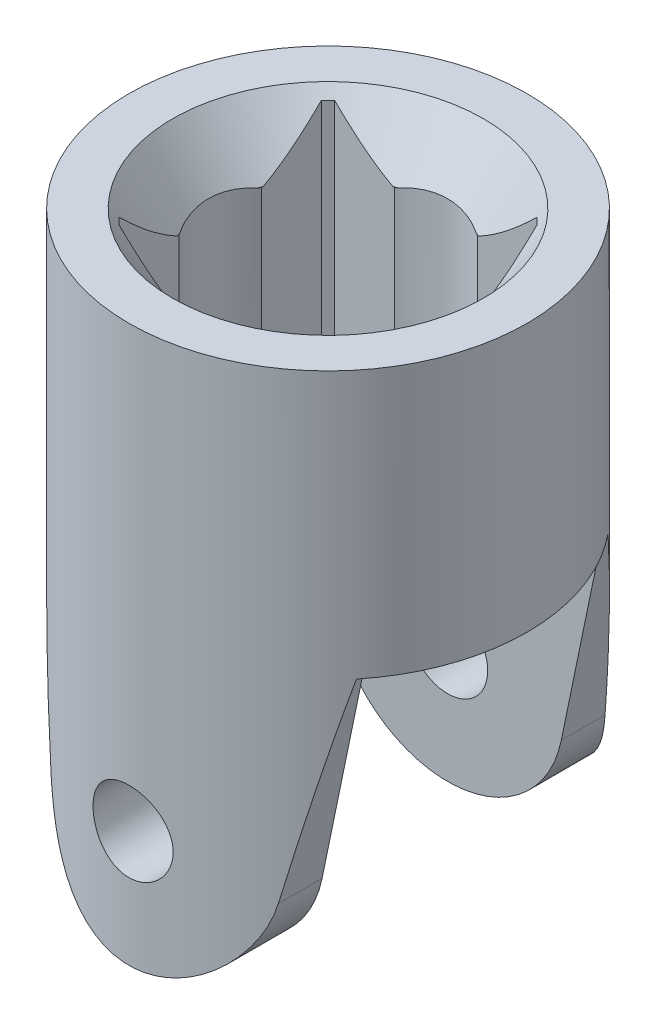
ISO-10303-21;
HEADER;
FILE_DESCRIPTION(('STEP AP214'),'2;1');
FILE_NAME('part.step','',(''),(''),'','','');
FILE_SCHEMA(('AUTOMOTIVE_DESIGN { 1 0 10303 214 1 1 1 1 }'));
ENDSEC;
DATA;
#1=APPLICATION_CONTEXT('core data for automotive mechanical design processes');
#2=APPLICATION_PROTOCOL_DEFINITION('international standard','automotive_design',2000,#1);
#3=PRODUCT_CONTEXT('',#1,'mechanical');
#4=PRODUCT('Part','Part','',(#3));
#5=PRODUCT_RELATED_PRODUCT_CATEGORY('part','',(#4));
#6=PRODUCT_DEFINITION_FORMATION('','',#4);
#7=PRODUCT_DEFINITION_CONTEXT('part definition',#1,'design');
#8=PRODUCT_DEFINITION('design','',#6,#7);
#9=PRODUCT_DEFINITION_SHAPE('','',#8);
#10=(LENGTH_UNIT() NAMED_UNIT(*) SI_UNIT(.MILLI.,.METRE.));
#11=(NAMED_UNIT(*) PLANE_ANGLE_UNIT() SI_UNIT($,.RADIAN.));
#12=(NAMED_UNIT(*) SI_UNIT($,.STERADIAN.) SOLID_ANGLE_UNIT());
#13=UNCERTAINTY_MEASURE_WITH_UNIT(LENGTH_MEASURE(1.E-05),#10,'distance_accuracy_value','');
#14=(GEOMETRIC_REPRESENTATION_CONTEXT(3) GLOBAL_UNCERTAINTY_ASSIGNED_CONTEXT((#13)) GLOBAL_UNIT_ASSIGNED_CONTEXT((#10,
#11,#12)) REPRESENTATION_CONTEXT('',''));
#15=CARTESIAN_POINT('',(0.,0.,0.));
#16=DIRECTION('',(0.,0.,1.));
#17=DIRECTION('',(1.,0.,0.));
#18=AXIS2_PLACEMENT_3D('',#15,#16,#17);
#19=CARTESIAN_POINT('',(0.,33.53,0.));
#20=DIRECTION('',(0.,-1.,0.));
#21=DIRECTION('',(0.,0.,-1.));
#22=AXIS2_PLACEMENT_3D('',#19,#20,#21);
#23=CYLINDRICAL_SURFACE('',#22,12.);
#24=CARTESIAN_POINT('',(0.,9.415,-12.));
#25=CARTESIAN_POINT('',(-0.134200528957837,9.41499508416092,-11.9999975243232));
#26=CARTESIAN_POINT('',(-0.268463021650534,9.40377600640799,-11.9977256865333));
#27=CARTESIAN_POINT('',(-0.533191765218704,9.35923245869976,-11.9888820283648));
#28=CARTESIAN_POINT('',(-0.663654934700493,9.32589054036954,-11.982306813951));
#29=CARTESIAN_POINT('',(-0.916919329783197,9.23817398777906,-11.9655904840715));
#30=CARTESIAN_POINT('',(-1.0397278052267,9.18381961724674,-11.9554528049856));
#31=CARTESIAN_POINT('',(-1.27447393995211,9.055681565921,-11.9327130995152));
#32=CARTESIAN_POINT('',(-1.38641222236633,8.98189899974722,-11.9201112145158));
#33=CARTESIAN_POINT('',(-1.59778270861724,8.81592712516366,-11.8936365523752));
#34=CARTESIAN_POINT('',(-1.69704449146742,8.72352294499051,-11.8797500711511));
#35=CARTESIAN_POINT('',(-1.87876851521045,8.52339272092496,-11.8523708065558));
#36=CARTESIAN_POINT('',(-1.96122943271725,8.41566547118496,-11.83887805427));
#37=CARTESIAN_POINT('',(-2.10773804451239,8.18671904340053,-11.8136800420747));
#38=CARTESIAN_POINT('',(-2.17160895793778,8.06538462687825,-11.8019924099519));
#39=CARTESIAN_POINT('',(-2.27799188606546,7.81343210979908,-11.7819227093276));
#40=CARTESIAN_POINT('',(-2.32050603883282,7.68281494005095,-11.7735403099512));
#41=CARTESIAN_POINT('',(-2.38241473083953,7.41783920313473,-11.7611688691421));
#42=CARTESIAN_POINT('',(-2.40210845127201,7.28355324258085,-11.7571230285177));
#43=CARTESIAN_POINT('',(-2.4187465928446,7.01352695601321,-11.7537118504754));
#44=CARTESIAN_POINT('',(-2.41569336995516,6.87778678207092,-11.7543460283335));
#45=CARTESIAN_POINT('',(-2.38716611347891,6.61089635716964,-11.7601716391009));
#46=CARTESIAN_POINT('',(-2.36203534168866,6.47970766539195,-11.7652932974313));
#47=CARTESIAN_POINT('',(-2.29060831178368,6.22344730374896,-11.7794068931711));
#48=CARTESIAN_POINT('',(-2.24431103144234,6.09837592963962,-11.7883990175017));
#49=CARTESIAN_POINT('',(-2.13153823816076,5.85691283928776,-11.8093115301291));
#50=CARTESIAN_POINT('',(-2.06492693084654,5.74058631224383,-11.8212515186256));
#51=CARTESIAN_POINT('',(-1.91351272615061,5.52063332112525,-11.8467018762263));
#52=CARTESIAN_POINT('',(-1.82870771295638,5.41700833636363,-11.8602124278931));
#53=CARTESIAN_POINT('',(-1.64147686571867,5.22341954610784,-11.8875837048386));
#54=CARTESIAN_POINT('',(-1.53875813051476,5.13373905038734,-11.9014463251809));
#55=CARTESIAN_POINT('',(-1.31958830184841,4.97283627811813,-11.9277344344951));
#56=CARTESIAN_POINT('',(-1.20313702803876,4.9016142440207,-11.940159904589));
#57=CARTESIAN_POINT('',(-0.959491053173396,4.77959659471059,-11.9622048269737));
#58=CARTESIAN_POINT('',(-0.832279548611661,4.72883366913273,-11.9718197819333));
#59=CARTESIAN_POINT('',(-0.570897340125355,4.64947890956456,-11.9871262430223));
#60=CARTESIAN_POINT('',(-0.436727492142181,4.62088435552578,-11.9928182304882));
#61=CARTESIAN_POINT('',(-0.16767148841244,4.58707983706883,-11.9995702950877));
#62=CARTESIAN_POINT('',(-0.0328359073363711,4.58148220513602,-12.0007071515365));
#63=CARTESIAN_POINT('',(0.235843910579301,4.59278595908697,-11.9984342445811));
#64=CARTESIAN_POINT('',(0.369688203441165,4.60968606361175,-11.9950247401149));
#65=CARTESIAN_POINT('',(0.631333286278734,4.66518352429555,-11.9840902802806));
#66=CARTESIAN_POINT('',(0.75917804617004,4.70358168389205,-11.9766031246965));
#67=CARTESIAN_POINT('',(1.00661431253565,4.80076737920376,-11.9583499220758));
#68=CARTESIAN_POINT('',(1.1262051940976,4.85955645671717,-11.9475836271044));
#69=CARTESIAN_POINT('',(1.35537185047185,4.99669185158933,-11.9237753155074));
#70=CARTESIAN_POINT('',(1.46480536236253,5.07527120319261,-11.9107067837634));
#71=CARTESIAN_POINT('',(1.66907212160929,5.24944487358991,-11.8838054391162));
#72=CARTESIAN_POINT('',(1.76390378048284,5.34504104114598,-11.8699725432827));
#73=CARTESIAN_POINT('',(1.93777345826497,5.5523004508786,-11.8428423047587));
#74=CARTESIAN_POINT('',(2.0165451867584,5.66418885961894,-11.8295565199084));
#75=CARTESIAN_POINT('',(2.15417760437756,5.89983671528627,-11.805270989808));
#76=CARTESIAN_POINT('',(2.21303909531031,6.02359568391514,-11.7942711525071));
#77=CARTESIAN_POINT('',(2.30881809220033,6.27884485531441,-11.7758965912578));
#78=CARTESIAN_POINT('',(2.34585010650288,6.41029066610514,-11.7685029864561));
#79=CARTESIAN_POINT('',(2.39726554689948,6.6777039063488,-11.7581383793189));
#80=CARTESIAN_POINT('',(2.41165196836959,6.81367073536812,-11.7551667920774));
#81=CARTESIAN_POINT('',(2.41725590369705,7.08359211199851,-11.7540154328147));
#82=CARTESIAN_POINT('',(2.40889428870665,7.2175377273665,-11.755748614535));
#83=CARTESIAN_POINT('',(2.37016915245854,7.48207118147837,-11.7636168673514));
#84=CARTESIAN_POINT('',(2.33980581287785,7.6126590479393,-11.7697519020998));
#85=CARTESIAN_POINT('',(2.25812789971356,7.86649803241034,-11.7856934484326));
#86=CARTESIAN_POINT('',(2.20686555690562,7.98976656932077,-11.7954908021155));
#87=CARTESIAN_POINT('',(2.08489335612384,8.22601894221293,-11.8176581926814));
#88=CARTESIAN_POINT('',(2.01418184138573,8.33900190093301,-11.8300284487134));
#89=CARTESIAN_POINT('',(1.85388372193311,8.55357031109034,-11.856213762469));
#90=CARTESIAN_POINT('',(1.76399342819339,8.65492634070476,-11.8700500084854));
#91=CARTESIAN_POINT('',(1.56851565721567,8.84125488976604,-11.8974568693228));
#92=CARTESIAN_POINT('',(1.46292457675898,8.92622363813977,-11.911027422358));
#93=CARTESIAN_POINT('',(1.23769466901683,9.07821862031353,-11.9365438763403));
#94=CARTESIAN_POINT('',(1.11791855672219,9.14504470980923,-11.948470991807));
#95=CARTESIAN_POINT('',(0.868629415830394,9.25751445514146,-11.9691716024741));
#96=CARTESIAN_POINT('',(0.739125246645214,9.3031771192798,-11.9779479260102));
#97=CARTESIAN_POINT('',(0.507783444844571,9.36322525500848,-11.9896619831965));
#98=CARTESIAN_POINT('',(0.407258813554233,9.3826060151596,-11.9935159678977));
#99=CARTESIAN_POINT('',(0.204501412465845,9.40849505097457,-11.9986858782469));
#100=CARTESIAN_POINT('',(0.102268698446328,9.41500374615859,-12.0000018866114));
#101=CARTESIAN_POINT('',(0.,9.415,-12.));
#102=B_SPLINE_CURVE_WITH_KNOTS('',3,(#24,#25,#26,#27,#28,#29,#30,#31,#32,#33,#34,#35,#36,#37,
#38,#39,#40,#41,#42,#43,#44,#45,#46,#47,#48,#49,#50,#51,#52,#53,#54,#55,#56,#57,#58,#59,#60,#61,
#62,#63,#64,#65,#66,#67,#68,#69,#70,#71,#72,#73,#74,#75,#76,#77,#78,#79,#80,#81,#82,#83,#84,#85,
#86,#87,#88,#89,#90,#91,#92,#93,#94,#95,#96,#97,#98,#99,#100,#101),.UNSPECIFIED.,.T.,.F.,(4,2,2,
2,2,2,2,2,2,2,2,2,2,2,2,2,2,2,2,2,2,2,2,2,2,2,2,2,2,2,2,2,2,2,2,2,2,2,4),(0.,0.402227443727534,
0.804772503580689,1.20693032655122,1.60906508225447,2.01613716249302,2.42324129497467,
2.83409894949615,3.24491546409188,3.65028286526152,4.0556082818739,4.45474106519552,
4.85389312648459,5.25577418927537,5.65770201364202,6.06695302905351,6.47620941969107,
6.88611715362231,7.29597458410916,7.69889381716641,8.10179010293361,8.5010135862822,
8.90026726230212,9.30446206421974,9.70870080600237,10.1191773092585,10.5296372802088,
10.9379245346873,11.3461577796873,11.7468897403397,12.1476183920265,12.5473516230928,
12.9471189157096,13.3537611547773,13.7604968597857,14.1715523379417,14.5822379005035,
14.8887688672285,15.1952898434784),.UNSPECIFIED.);
#103=CARTESIAN_POINT('',(0.,9.415,-12.));
#104=VERTEX_POINT('',#103);
#105=EDGE_CURVE('E304',#104,#104,#102,.T.);
#106=ORIENTED_EDGE('',*,*,#105,.T.);
#107=EDGE_LOOP('',(#106));
#108=FACE_BOUND('',#107,.T.);
#109=CARTESIAN_POINT('',(2.415,7.,11.754478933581));
#110=CARTESIAN_POINT('',(2.41499506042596,6.86583049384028,11.7544816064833));
#111=CARTESIAN_POINT('',(2.40378099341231,6.7315989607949,11.7568010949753));
#112=CARTESIAN_POINT('',(2.3592591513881,6.46693449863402,11.765814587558));
#113=CARTESIAN_POINT('',(2.32593380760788,6.3365046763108,11.7725120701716));
#114=CARTESIAN_POINT('',(2.23826571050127,6.08331090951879,11.7894929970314));
#115=CARTESIAN_POINT('',(2.18394399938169,5.96053943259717,11.7997728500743));
#116=CARTESIAN_POINT('',(2.0558829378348,5.72585568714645,11.8227559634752));
#117=CARTESIAN_POINT('',(1.98214462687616,5.61394283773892,11.8354590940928));
#118=CARTESIAN_POINT('',(1.81621814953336,5.40254528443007,11.8620606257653));
#119=CARTESIAN_POINT('',(1.72380517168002,5.30323867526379,11.8759722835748));
#120=CARTESIAN_POINT('',(1.52363831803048,5.12142766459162,11.903306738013));
#121=CARTESIAN_POINT('',(1.4158833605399,5.03892444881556,11.9167295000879));
#122=CARTESIAN_POINT('',(1.18691102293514,4.89237025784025,11.9417168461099));
#123=CARTESIAN_POINT('',(1.06558316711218,4.82848865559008,11.9532639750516));
#124=CARTESIAN_POINT('',(0.81364483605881,4.72208417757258,11.9730500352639));
#125=CARTESIAN_POINT('',(0.683035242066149,4.67955927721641,11.9812892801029));
#126=CARTESIAN_POINT('',(0.418089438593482,4.61763009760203,11.9934375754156));
#127=CARTESIAN_POINT('',(0.283826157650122,4.59792503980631,11.9974029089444));
#128=CARTESIAN_POINT('',(0.0138447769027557,4.58125635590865,12.0007510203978));
#129=CARTESIAN_POINT('',(-0.121873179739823,4.58429051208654,12.0001342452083));
#130=CARTESIAN_POINT('',(-0.388844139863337,4.61278626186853,11.9944312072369));
#131=CARTESIAN_POINT('',(-0.520133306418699,4.63792385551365,11.9894095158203));
#132=CARTESIAN_POINT('',(-0.776591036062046,4.70939885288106,11.9755337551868));
#133=CARTESIAN_POINT('',(-0.901759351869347,4.7557371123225,11.966679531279));
#134=CARTESIAN_POINT('',(-1.14334501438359,4.86859735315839,11.9460273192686));
#135=CARTESIAN_POINT('',(-1.25970154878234,4.93524600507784,11.9342109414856));
#136=CARTESIAN_POINT('',(-1.4796989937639,5.08674134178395,11.9089365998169));
#137=CARTESIAN_POINT('',(-1.58333842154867,5.17159014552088,11.8954784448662));
#138=CARTESIAN_POINT('',(-1.77688275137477,5.35885381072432,11.868126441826));
#139=CARTESIAN_POINT('',(-1.86651301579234,5.46155222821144,11.8542290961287));
#140=CARTESIAN_POINT('',(-2.02732387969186,5.68066292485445,11.8277901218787));
#141=CARTESIAN_POINT('',(-2.0985041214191,5.79707546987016,11.8152485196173));
#142=CARTESIAN_POINT('',(-2.2204908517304,6.04070749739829,11.7929340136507));
#143=CARTESIAN_POINT('',(-2.27125240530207,6.16795007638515,11.783167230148));
#144=CARTESIAN_POINT('',(-2.35059506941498,6.42940031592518,11.7675976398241));
#145=CARTESIAN_POINT('',(-2.37917911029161,6.56360705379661,11.7617943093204));
#146=CARTESIAN_POINT('',(-2.41294389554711,6.83268551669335,11.7549137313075));
#147=CARTESIAN_POINT('',(-2.4185214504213,6.96750545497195,11.7537563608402));
#148=CARTESIAN_POINT('',(-2.40718313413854,7.23614930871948,11.7560836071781));
#149=CARTESIAN_POINT('',(-2.39026855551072,7.36997328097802,11.759567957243));
#150=CARTESIAN_POINT('',(-2.33476835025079,7.631489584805,11.7707109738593));
#151=CARTESIAN_POINT('',(-2.29639516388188,7.75922890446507,11.7783286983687));
#152=CARTESIAN_POINT('',(-2.19929435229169,8.00646522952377,11.796844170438));
#153=CARTESIAN_POINT('',(-2.14056503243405,8.12596154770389,11.8077421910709));
#154=CARTESIAN_POINT('',(-2.00352236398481,8.35505492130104,11.831770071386));
#155=CARTESIAN_POINT('',(-1.92496096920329,8.46450065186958,11.8449274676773));
#156=CARTESIAN_POINT('',(-1.7508144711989,8.66880030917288,11.8719162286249));
#157=CARTESIAN_POINT('',(-1.65522759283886,8.76365271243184,11.8857476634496));
#158=CARTESIAN_POINT('',(-1.44796121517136,8.93757998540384,11.9127863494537));
#159=CARTESIAN_POINT('',(-1.33605447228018,9.01638641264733,11.9259805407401));
#160=CARTESIAN_POINT('',(-1.1003594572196,9.1540796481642,11.9500301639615));
#161=CARTESIAN_POINT('',(-0.976571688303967,9.21296729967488,11.9608856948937));
#162=CARTESIAN_POINT('',(-0.721330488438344,9.30876122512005,11.9789791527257));
#163=CARTESIAN_POINT('',(-0.589925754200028,9.3457931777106,11.986237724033));
#164=CARTESIAN_POINT('',(-0.32260017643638,9.39722236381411,11.9964080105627));
#165=CARTESIAN_POINT('',(-0.186679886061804,9.41162235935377,11.9993202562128));
#166=CARTESIAN_POINT('',(0.0832554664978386,9.4172707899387,12.0004570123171));
#167=CARTESIAN_POINT('',(0.217261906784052,9.40892263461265,11.998763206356));
#168=CARTESIAN_POINT('',(0.481920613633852,9.3702032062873,11.9910501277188));
#169=CARTESIAN_POINT('',(0.612572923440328,9.3398322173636,11.9850309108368));
#170=CARTESIAN_POINT('',(0.866559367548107,9.25810946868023,11.9693458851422));
#171=CARTESIAN_POINT('',(0.989909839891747,9.20680674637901,11.9596886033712));
#172=CARTESIAN_POINT('',(1.22630958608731,9.08472811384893,11.9377667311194));
#173=CARTESIAN_POINT('',(1.3393580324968,9.01395064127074,11.9255019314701));
#174=CARTESIAN_POINT('',(1.55393764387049,8.853573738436,11.899460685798));
#175=CARTESIAN_POINT('',(1.65525076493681,8.76368601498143,11.8856628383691));
#176=CARTESIAN_POINT('',(1.84149393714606,8.56823182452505,11.8582369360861));
#177=CARTESIAN_POINT('',(1.92642009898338,8.46266164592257,11.8446089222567));
#178=CARTESIAN_POINT('',(2.07836147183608,8.2374544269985,11.818901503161));
#179=CARTESIAN_POINT('',(2.14517071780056,8.11767621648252,11.806840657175));
#180=CARTESIAN_POINT('',(2.25760841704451,7.86838419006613,11.7858602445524));
#181=CARTESIAN_POINT('',(2.3032560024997,7.73887929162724,11.7769378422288));
#182=CARTESIAN_POINT('',(2.36326781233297,7.50757609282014,11.7650172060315));
#183=CARTESIAN_POINT('',(2.38263251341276,7.40709311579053,11.761089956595));
#184=CARTESIAN_POINT('',(2.40850026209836,7.20441872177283,11.7558198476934));
#185=CARTESIAN_POINT('',(2.41500376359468,7.10222736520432,11.7544768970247));
#186=CARTESIAN_POINT('',(2.415,7.,11.754478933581));
#187=B_SPLINE_CURVE_WITH_KNOTS('',3,(#109,#110,#111,#112,#113,#114,#115,#116,#117,#118,#119,
#120,#121,#122,#123,#124,#125,#126,#127,#128,#129,#130,#131,#132,#133,#134,#135,#136,#137,#138,
#139,#140,#141,#142,#143,#144,#145,#146,#147,#148,#149,#150,#151,#152,#153,#154,#155,#156,#157,
#158,#159,#160,#161,#162,#163,#164,#165,#166,#167,#168,#169,#170,#171,#172,#173,#174,#175,#176,
#177,#178,#179,#180,#181,#182,#183,#184,#185,#186),.UNSPECIFIED.,.T.,.F.,(4,2,2,2,2,2,2,2,2,2,2,
2,2,2,2,2,2,2,2,2,2,2,2,2,2,2,2,2,2,2,2,2,2,2,2,2,2,2,4),(0.,0.402134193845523,
0.804588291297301,1.20664009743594,1.60867038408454,2.01586449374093,2.42308732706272,
2.83390608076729,3.24468588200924,3.6499874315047,4.05524945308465,4.45466821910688,
4.85410310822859,5.25608199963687,5.65810771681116,6.06722773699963,6.47635568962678,
6.88637914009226,7.29634840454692,7.69921626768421,8.10206098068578,8.50098638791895,
8.8999450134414,9.30416480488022,9.70842676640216,10.1189785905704,10.5295130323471,
10.9376631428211,11.3457634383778,11.7466739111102,12.1475792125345,12.547550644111,
12.9475541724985,13.354085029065,13.760712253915,14.1717849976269,14.5824853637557,
14.8888930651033,15.1952899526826),.UNSPECIFIED.);
#188=CARTESIAN_POINT('',(2.415,7.,11.754478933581));
#189=VERTEX_POINT('',#188);
#190=EDGE_CURVE('E343',#189,#189,#187,.T.);
#191=ORIENTED_EDGE('',*,*,#190,.T.);
#192=EDGE_LOOP('',(#191));
#193=FACE_BOUND('',#192,.T.);
#194=CARTESIAN_POINT('',(0.,33.53,0.));
#195=DIRECTION('',(0.,1.,0.));
#196=DIRECTION('',(0.,0.,1.));
#197=AXIS2_PLACEMENT_3D('',#194,#195,#196);
#198=CIRCLE('',#197,12.);
#199=CARTESIAN_POINT('',(0.,33.53,12.));
#200=VERTEX_POINT('',#199);
#201=EDGE_CURVE('E641',#200,#200,#198,.T.);
#202=ORIENTED_EDGE('',*,*,#201,.F.);
#203=EDGE_LOOP('',(#202));
#204=FACE_BOUND('',#203,.T.);
#205=CARTESIAN_POINT('',(0.,-27.5495566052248,0.));
#206=DIRECTION('',(-0.979260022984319,0.202607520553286,0.));
#207=DIRECTION('',(-0.202607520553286,-0.979260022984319,0.));
#208=AXIS2_PLACEMENT_3D('',#205,#206,#207);
#209=ELLIPSE('',#208,59.2278113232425,12.);
#210=CARTESIAN_POINT('',(6.85482016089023,5.581747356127,9.84943859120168));
#211=VERTEX_POINT('',#210);
#212=CARTESIAN_POINT('',(9.3,17.4,7.58353479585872));
#213=VERTEX_POINT('',#212);
#214=EDGE_CURVE('E363',#211,#213,#209,.T.);
#215=ORIENTED_EDGE('',*,*,#214,.T.);
#216=CARTESIAN_POINT('',(0.,17.4,0.));
#217=DIRECTION('',(0.,-1.,0.));
#218=DIRECTION('',(0.,0.,-1.));
#219=AXIS2_PLACEMENT_3D('',#216,#217,#218);
#220=CIRCLE('',#219,12.);
#221=CARTESIAN_POINT('',(9.3,17.4,-7.58353479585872));
#222=VERTEX_POINT('',#221);
#223=EDGE_CURVE('E438',#222,#213,#220,.T.);
#224=ORIENTED_EDGE('',*,*,#223,.F.);
#225=CARTESIAN_POINT('',(6.85482016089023,5.581747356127,-9.84943859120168));
#226=VERTEX_POINT('',#225);
#227=EDGE_CURVE('E298',#222,#226,#209,.T.);
#228=ORIENTED_EDGE('',*,*,#227,.T.);
#229=CARTESIAN_POINT('',(-6.85482016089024,5.581747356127,-9.84943859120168));
#230=CARTESIAN_POINT('',(-6.81514650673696,5.38988681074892,-9.87702277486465));
#231=CARTESIAN_POINT('',(-6.7675492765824,5.20052902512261,-9.90982166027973));
#232=CARTESIAN_POINT('',(-6.65739630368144,4.82821973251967,-9.98416828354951));
#233=CARTESIAN_POINT('',(-6.59485849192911,4.64526084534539,-10.0257055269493));
#234=CARTESIAN_POINT('',(-6.4559583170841,4.28757217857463,-10.1156991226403));
#235=CARTESIAN_POINT('',(-6.37966579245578,4.11280620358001,-10.1641202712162));
#236=CARTESIAN_POINT('',(-6.21381257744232,3.77128809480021,-10.2663545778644));
#237=CARTESIAN_POINT('',(-6.12424777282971,3.6045384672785,-10.3201694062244));
#238=CARTESIAN_POINT('',(-5.93298101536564,3.28046084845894,-10.4312940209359));
#239=CARTESIAN_POINT('',(-5.83133481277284,3.12309425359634,-10.4885871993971));
#240=CARTESIAN_POINT('',(-5.61625772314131,2.81758659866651,-10.6053129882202));
#241=CARTESIAN_POINT('',(-5.50282794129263,2.66944467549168,-10.6647453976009));
#242=CARTESIAN_POINT('',(-5.14506496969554,2.23895673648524,-10.8443217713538));
#243=CARTESIAN_POINT('',(-4.88349506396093,1.97094845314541,-10.9656013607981));
#244=CARTESIAN_POINT('',(-4.4462929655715,1.58954846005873,-11.1471469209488));
#245=CARTESIAN_POINT('',(-4.28488126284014,1.46080729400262,-11.2103341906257));
#246=CARTESIAN_POINT('',(-3.95029080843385,1.21744632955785,-11.3325569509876));
#247=CARTESIAN_POINT('',(-3.777117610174,1.10281993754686,-11.3915943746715));
#248=CARTESIAN_POINT('',(-3.419960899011,0.888763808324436,-11.5038650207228));
#249=CARTESIAN_POINT('',(-3.23598255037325,0.789326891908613,-11.5571009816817));
#250=CARTESIAN_POINT('',(-2.85826710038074,0.60670067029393,-11.6562598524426));
#251=CARTESIAN_POINT('',(-2.66453279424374,0.52350674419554,-11.7021848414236));
#252=CARTESIAN_POINT('',(-2.30545209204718,0.388300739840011,-11.7776074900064));
#253=CARTESIAN_POINT('',(-2.14150753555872,0.333367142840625,-11.8085721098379));
#254=CARTESIAN_POINT('',(-1.80900355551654,0.235569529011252,-11.8640589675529));
#255=CARTESIAN_POINT('',(-1.64044497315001,0.192703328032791,-11.8885823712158));
#256=CARTESIAN_POINT('',(-1.30018236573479,0.119612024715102,-11.9305845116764));
#257=CARTESIAN_POINT('',(-1.12848696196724,0.0893565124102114,-11.9480801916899));
#258=CARTESIAN_POINT('',(-0.782799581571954,0.0417219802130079,-11.9756942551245));
#259=CARTESIAN_POINT('',(-0.608808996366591,0.024335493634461,-11.985816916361));
#260=CARTESIAN_POINT('',(-0.362060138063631,0.00899416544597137,-11.9947552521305));
#261=CARTESIAN_POINT('',(-0.289709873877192,0.00562266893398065,-11.9967208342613));
#262=CARTESIAN_POINT('',(-0.144909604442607,0.00112517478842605,-11.9993435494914));
#263=CARTESIAN_POINT('',(-0.0724595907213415,-6.18585381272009E-07,-12.0000005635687));
#264=CARTESIAN_POINT('',(0.179947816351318,1.53620918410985E-06,-11.9999986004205));
#265=CARTESIAN_POINT('',(0.359954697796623,0.00695009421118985,-11.995941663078));
#266=CARTESIAN_POINT('',(0.718620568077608,0.0346590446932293,-11.9798101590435));
#267=CARTESIAN_POINT('',(0.897278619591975,0.0554282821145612,-11.9677304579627));
#268=CARTESIAN_POINT('',(1.25216282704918,0.110559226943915,-11.9358237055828));
#269=CARTESIAN_POINT('',(1.42838324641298,0.144948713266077,-11.9159808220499));
#270=CARTESIAN_POINT('',(1.77681315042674,0.226892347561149,-11.8690295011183));
#271=CARTESIAN_POINT('',(1.9490208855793,0.274452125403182,-11.841917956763));
#272=CARTESIAN_POINT('',(2.28733934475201,0.381888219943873,-11.7812328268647));
#273=CARTESIAN_POINT('',(2.45347763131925,0.44169766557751,-11.7476943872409));
#274=CARTESIAN_POINT('',(2.7797066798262,0.573165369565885,-11.6748114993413));
#275=CARTESIAN_POINT('',(2.93979508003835,0.644828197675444,-11.6354648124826));
#276=CARTESIAN_POINT('',(3.409476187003,0.876511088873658,-11.510002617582));
#277=CARTESIAN_POINT('',(3.70895462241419,1.05337672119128,-11.4163771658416));
#278=CARTESIAN_POINT('',(4.29650520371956,1.4612716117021,-11.2091204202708));
#279=CARTESIAN_POINT('',(4.58210072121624,1.69533674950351,-11.0945222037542));
#280=CARTESIAN_POINT('',(5.11266678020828,2.2045898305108,-10.8602377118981));
#281=CARTESIAN_POINT('',(5.35756929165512,2.47984520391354,-10.7405433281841));
#282=CARTESIAN_POINT('',(5.70377366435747,2.93685211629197,-10.5587252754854));
#283=CARTESIAN_POINT('',(5.82071004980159,3.10617415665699,-10.4945339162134));
#284=CARTESIAN_POINT('',(6.03983748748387,3.45558599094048,-10.3699673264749));
#285=CARTESIAN_POINT('',(6.14202431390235,3.63567884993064,-10.3095931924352));
#286=CARTESIAN_POINT('',(6.330381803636,4.00514777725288,-10.1950181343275));
#287=CARTESIAN_POINT('',(6.41660265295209,4.1944923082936,-10.1407980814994));
#288=CARTESIAN_POINT('',(6.57238233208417,4.58188163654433,-10.0405365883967));
#289=CARTESIAN_POINT('',(6.64195589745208,4.77991855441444,-9.99448792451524));
#290=CARTESIAN_POINT('',(6.7323312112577,5.08002738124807,-9.93362928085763));
#291=CARTESIAN_POINT('',(6.75986702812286,5.17932484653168,-9.91489563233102));
#292=CARTESIAN_POINT('',(6.81061059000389,5.37943450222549,-9.88010720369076));
#293=CARTESIAN_POINT('',(6.83382019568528,5.48024602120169,-9.86405127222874));
#294=CARTESIAN_POINT('',(6.85482016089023,5.58174735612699,-9.84943859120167));
#295=B_SPLINE_CURVE_WITH_KNOTS('',3,(#229,#230,#231,#232,#233,#234,#235,#236,#237,#238,#239,
#240,#241,#242,#243,#244,#245,#246,#247,#248,#249,#250,#251,#252,#253,#254,#255,#256,#257,#258,
#259,#260,#261,#262,#263,#264,#265,#266,#267,#268,#269,#270,#271,#272,#273,#274,#275,#276,#277,
#278,#279,#280,#281,#282,#283,#284,#285,#286,#287,#288,#289,#290,#291,#292,#293,#294),
.UNSPECIFIED.,.F.,.F.,(4,2,2,2,2,2,2,2,2,2,2,2,2,2,2,2,2,2,2,2,2,2,2,2,2,2,2,2,2,2,2,2,4),(0.,
0.593154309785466,1.18560028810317,1.77511880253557,2.36482044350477,2.9518994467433,
3.53892343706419,4.71441653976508,5.36153158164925,6.00834317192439,6.65484809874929,
7.3011688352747,7.82757699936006,8.35388982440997,8.87892602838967,9.4036573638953,
9.62098572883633,9.83833386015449,10.3781012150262,10.9182143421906,11.4594347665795,
12.0008869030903,12.5394584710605,13.0782381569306,14.1543105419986,15.309869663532,
16.4673416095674,17.1133407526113,17.7595246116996,18.4036414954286,19.0471861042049,
19.3612699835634,19.6752184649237),.UNSPECIFIED.);
#296=CARTESIAN_POINT('',(-6.85482016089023,5.581747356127,-9.84943859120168));
#297=VERTEX_POINT('',#296);
#298=EDGE_CURVE('E290',#297,#226,#295,.T.);
#299=ORIENTED_EDGE('',*,*,#298,.F.);
#300=CARTESIAN_POINT('',(0.,-27.5495566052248,0.));
#301=DIRECTION('',(-0.979260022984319,-0.202607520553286,0.));
#302=DIRECTION('',(0.202607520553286,-0.979260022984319,0.));
#303=AXIS2_PLACEMENT_3D('',#300,#301,#302);
#304=ELLIPSE('',#303,59.2278113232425,12.);
#305=CARTESIAN_POINT('',(-9.3,17.4,-7.58353479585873));
#306=VERTEX_POINT('',#305);
#307=EDGE_CURVE('E278',#306,#297,#304,.T.);
#308=ORIENTED_EDGE('',*,*,#307,.F.);
#309=CARTESIAN_POINT('',(-9.3,17.4,7.58353479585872));
#310=VERTEX_POINT('',#309);
#311=EDGE_CURVE('E437',#310,#306,#220,.T.);
#312=ORIENTED_EDGE('',*,*,#311,.F.);
#313=CARTESIAN_POINT('',(-6.85482016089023,5.581747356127,9.84943859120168));
#314=VERTEX_POINT('',#313);
#315=EDGE_CURVE('E284',#314,#310,#304,.T.);
#316=ORIENTED_EDGE('',*,*,#315,.F.);
#317=CARTESIAN_POINT('',(6.85482016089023,5.58174735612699,9.84943859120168));
#318=CARTESIAN_POINT('',(6.81514393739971,5.38988285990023,9.87702396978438));
#319=CARTESIAN_POINT('',(6.76754789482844,5.20052668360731,9.90982232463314));
#320=CARTESIAN_POINT('',(6.65739728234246,4.82822071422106,9.98416789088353));
#321=CARTESIAN_POINT('',(6.59486065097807,4.64526353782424,10.02570460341));
#322=CARTESIAN_POINT('',(6.45595544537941,4.28756763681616,10.1157005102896));
#323=CARTESIAN_POINT('',(6.37965677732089,4.11279275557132,10.1641244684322));
#324=CARTESIAN_POINT('',(6.21382117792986,3.77130068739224,10.2663506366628));
#325=CARTESIAN_POINT('',(6.12428013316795,3.60458602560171,10.3201545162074));
#326=CARTESIAN_POINT('',(5.83764715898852,3.11894401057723,10.4866745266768));
#327=CARTESIAN_POINT('',(5.62180642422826,2.81263994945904,10.6050028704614));
#328=CARTESIAN_POINT('',(5.26428852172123,2.38240004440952,10.7844895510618));
#329=CARTESIAN_POINT('',(5.13930512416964,2.24369479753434,10.8447304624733));
#330=CARTESIAN_POINT('',(4.87844790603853,1.97649824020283,10.9645479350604));
#331=CARTESIAN_POINT('',(4.74257312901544,1.84800782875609,11.0241244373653));
#332=CARTESIAN_POINT('',(4.44635142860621,1.58960518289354,11.1471159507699));
#333=CARTESIAN_POINT('',(4.28491627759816,1.46083781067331,11.2103183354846));
#334=CARTESIAN_POINT('',(3.95031309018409,1.2174574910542,11.3325518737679));
#335=CARTESIAN_POINT('',(3.77714970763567,1.10283897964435,11.3915846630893));
#336=CARTESIAN_POINT('',(3.42000829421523,0.888792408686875,11.5038497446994));
#337=CARTESIAN_POINT('',(3.23603606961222,0.789356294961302,11.5570851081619));
#338=CARTESIAN_POINT('',(2.85831476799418,0.606720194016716,11.6562491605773));
#339=CARTESIAN_POINT('',(2.66456680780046,0.523518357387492,11.7021786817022));
#340=CARTESIAN_POINT('',(2.28128603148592,0.379202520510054,11.7826824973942));
#341=CARTESIAN_POINT('',(2.09226839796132,0.317020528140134,11.8177930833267));
#342=CARTESIAN_POINT('',(1.70829857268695,0.208719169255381,11.8793732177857));
#343=CARTESIAN_POINT('',(1.51334657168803,0.162599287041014,11.9058430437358));
#344=CARTESIAN_POINT('',(1.11933900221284,0.0871655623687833,11.9493234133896));
#345=CARTESIAN_POINT('',(0.920286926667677,0.0578379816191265,11.9663416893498));
#346=CARTESIAN_POINT('',(0.519807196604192,0.0164258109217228,11.9904137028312));
#347=CARTESIAN_POINT('',(0.318379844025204,0.00433905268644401,11.9974686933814));
#348=CARTESIAN_POINT('',(-0.0589861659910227,-0.00195950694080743,12.001143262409));
#349=CARTESIAN_POINT('',(-0.234882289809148,0.00173595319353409,11.9989846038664));
#350=CARTESIAN_POINT('',(-0.585636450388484,0.0223294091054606,11.9869852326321));
#351=CARTESIAN_POINT('',(-0.760494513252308,0.0392270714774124,11.9771447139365));
#352=CARTESIAN_POINT('',(-1.10786145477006,0.0860028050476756,11.9500207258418));
#353=CARTESIAN_POINT('',(-1.28037048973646,0.115880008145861,11.9327377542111));
#354=CARTESIAN_POINT('',(-1.62185475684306,0.188241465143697,11.8911386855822));
#355=CARTESIAN_POINT('',(-1.79082989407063,0.23072605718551,11.8668223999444));
#356=CARTESIAN_POINT('',(-2.12110890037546,0.326924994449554,11.8122135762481));
#357=CARTESIAN_POINT('',(-2.28249667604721,0.3804186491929,11.7820390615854));
#358=CARTESIAN_POINT('',(-2.59997661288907,0.498550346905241,11.7160769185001));
#359=CARTESIAN_POINT('',(-2.75606701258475,0.563192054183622,11.6802874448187));
#360=CARTESIAN_POINT('',(-3.21512980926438,0.772964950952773,11.5655595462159));
#361=CARTESIAN_POINT('',(-3.50915343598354,0.934020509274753,11.4792170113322));
#362=CARTESIAN_POINT('',(-4.09694989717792,1.31232436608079,11.2836508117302));
#363=CARTESIAN_POINT('',(-4.38758937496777,1.53364741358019,11.1729873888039));
#364=CARTESIAN_POINT('',(-4.93009375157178,2.01739181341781,10.944444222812));
#365=CARTESIAN_POINT('',(-5.18189789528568,2.27987629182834,10.8265535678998));
#366=CARTESIAN_POINT('',(-5.54119702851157,2.71787104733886,10.6450066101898));
#367=CARTESIAN_POINT('',(-5.66352742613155,2.88099847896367,10.5802539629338));
#368=CARTESIAN_POINT('',(-5.89401300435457,3.21816237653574,10.4536058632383));
#369=CARTESIAN_POINT('',(-6.0021645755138,3.39220160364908,10.3917111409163));
#370=CARTESIAN_POINT('',(-6.20312595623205,3.74989176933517,10.2730144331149));
#371=CARTESIAN_POINT('',(-6.29597731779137,3.93351483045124,10.2161988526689));
#372=CARTESIAN_POINT('',(-6.46572713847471,4.30984557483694,10.1096196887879));
#373=CARTESIAN_POINT('',(-6.54263700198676,4.50254664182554,10.0598510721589));
#374=CARTESIAN_POINT('',(-6.66094071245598,4.84248425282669,9.98175611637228));
#375=CARTESIAN_POINT('',(-6.70630723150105,4.98785310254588,9.95127740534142));
#376=CARTESIAN_POINT('',(-6.78767868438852,5.28222141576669,9.89594769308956));
#377=CARTESIAN_POINT('',(-6.82368410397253,5.43122069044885,9.87109639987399));
#378=CARTESIAN_POINT('',(-6.85482016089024,5.581747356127,9.84943859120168));
#379=B_SPLINE_CURVE_WITH_KNOTS('',3,(#317,#318,#319,#320,#321,#322,#323,#324,#325,#326,#327,
#328,#329,#330,#331,#332,#333,#334,#335,#336,#337,#338,#339,#340,#341,#342,#343,#344,#345,#346,
#347,#348,#349,#350,#351,#352,#353,#354,#355,#356,#357,#358,#359,#360,#361,#362,#363,#364,#365,
#366,#367,#368,#369,#370,#371,#372,#373,#374,#375,#376,#377,#378),.UNSPECIFIED.,.F.,.F.,(4,2,2,
2,2,2,2,2,2,2,2,2,2,2,2,2,2,2,2,2,2,2,2,2,2,2,2,2,2,2,4),(0.,0.593155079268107,1.18560152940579,
1.77511923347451,2.36482044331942,3.53804996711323,4.12619669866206,4.71439513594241,
5.36146525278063,6.00828009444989,6.65475060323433,7.30114742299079,7.90644723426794,
8.51172760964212,9.11651207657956,9.72122047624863,10.2484127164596,10.7755916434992,
11.3027353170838,11.8298931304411,12.3473644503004,12.8650061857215,13.8994753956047,
15.0402945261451,16.1828806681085,16.824044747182,17.4653717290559,18.1049272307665,
18.744023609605,19.2095310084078,19.6750142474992),.UNSPECIFIED.);
#380=EDGE_CURVE('E299',#211,#314,#379,.T.);
#381=ORIENTED_EDGE('',*,*,#380,.F.);
#382=EDGE_LOOP('',(#215,#224,#228,#299,#308,#312,#316,#381));
#383=FACE_BOUND('',#382,.T.);
#384=ADVANCED_FACE('F62',(#108,#193,#204,#383),#23,.T.);
#385=CARTESIAN_POINT('',(-12.,17.4,7.21112639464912));
#386=DIRECTION('',(0.,0.,1.));
#387=DIRECTION('',(1.,0.,0.));
#388=AXIS2_PLACEMENT_3D('',#385,#386,#387);
#389=PLANE('',#388);
#390=CARTESIAN_POINT('',(0.,7.,7.21112639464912));
#391=DIRECTION('',(0.,0.,1.));
#392=DIRECTION('',(1.,0.,0.));
#393=AXIS2_PLACEMENT_3D('',#390,#391,#392);
#394=CIRCLE('',#393,2.415);
#395=CARTESIAN_POINT('',(2.415,7.,7.21112639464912));
#396=VERTEX_POINT('',#395);
#397=EDGE_CURVE('E355',#396,#396,#394,.T.);
#398=ORIENTED_EDGE('',*,*,#397,.T.);
#399=EDGE_LOOP('',(#398));
#400=FACE_BOUND('',#399,.T.);
#401=DIRECTION('',(-1.,0.,0.));
#402=VECTOR('',#401,1.);
#403=CARTESIAN_POINT('',(-12.,17.4,7.21112639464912));
#404=LINE('',#403,#402);
#405=CARTESIAN_POINT('',(9.3,17.4,7.21112639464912));
#406=VERTEX_POINT('',#405);
#407=CARTESIAN_POINT('',(0.,17.4,7.21112639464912));
#408=VERTEX_POINT('',#407);
#409=EDGE_CURVE('E404',#406,#408,#404,.T.);
#410=ORIENTED_EDGE('',*,*,#409,.F.);
#411=DIRECTION('',(-0.202607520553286,-0.979260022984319,0.));
#412=VECTOR('',#411,1.);
#413=CARTESIAN_POINT('',(8.42563910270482,13.1739640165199,7.21112639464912));
#414=LINE('',#413,#412);
#415=CARTESIAN_POINT('',(6.85482016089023,5.581747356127,7.21112639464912));
#416=VERTEX_POINT('',#415);
#417=EDGE_CURVE('E366',#406,#416,#414,.T.);
#418=ORIENTED_EDGE('',*,*,#417,.T.);
#419=CARTESIAN_POINT('',(0.,7.,7.21112639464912));
#420=DIRECTION('',(0.,0.,1.));
#421=DIRECTION('',(1.,0.,0.));
#422=AXIS2_PLACEMENT_3D('',#419,#420,#421);
#423=CIRCLE('',#422,7.);
#424=CARTESIAN_POINT('',(-6.85482016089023,5.581747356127,7.21112639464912));
#425=VERTEX_POINT('',#424);
#426=EDGE_CURVE('E300',#425,#416,#423,.T.);
#427=ORIENTED_EDGE('',*,*,#426,.F.);
#428=DIRECTION('',(0.202607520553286,-0.979260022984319,0.));
#429=VECTOR('',#428,1.);
#430=CARTESIAN_POINT('',(-9.41083447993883,17.9356947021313,7.21112639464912));
#431=LINE('',#430,#429);
#432=CARTESIAN_POINT('',(-9.3,17.4,7.21112639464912));
#433=VERTEX_POINT('',#432);
#434=EDGE_CURVE('E285',#433,#425,#431,.T.);
#435=ORIENTED_EDGE('',*,*,#434,.F.);
#436=EDGE_CURVE('E400',#408,#433,#404,.T.);
#437=ORIENTED_EDGE('',*,*,#436,.F.);
#438=EDGE_LOOP('',(#410,#418,#427,#435,#437));
#439=FACE_BOUND('',#438,.T.);
#440=ADVANCED_FACE('F634',(#400,#439),#389,.F.);
#441=CARTESIAN_POINT('',(-12.,17.4,-7.21112639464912));
#442=DIRECTION('',(0.,0.,-1.));
#443=DIRECTION('',(-1.,0.,0.));
#444=AXIS2_PLACEMENT_3D('',#441,#442,#443);
#445=PLANE('',#444);
#446=CARTESIAN_POINT('',(0.,7.,-7.21112639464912));
#447=DIRECTION('',(0.,0.,-1.));
#448=DIRECTION('',(-1.,0.,0.));
#449=AXIS2_PLACEMENT_3D('',#446,#447,#448);
#450=CIRCLE('',#449,2.415);
#451=CARTESIAN_POINT('',(-2.415,7.,-7.21112639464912));
#452=VERTEX_POINT('',#451);
#453=EDGE_CURVE('E359',#452,#452,#450,.T.);
#454=ORIENTED_EDGE('',*,*,#453,.T.);
#455=EDGE_LOOP('',(#454));
#456=FACE_BOUND('',#455,.T.);
#457=CARTESIAN_POINT('',(0.,7.,-7.21112639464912));
#458=DIRECTION('',(0.,0.,-1.));
#459=DIRECTION('',(-1.,0.,0.));
#460=AXIS2_PLACEMENT_3D('',#457,#458,#459);
#461=CIRCLE('',#460,7.);
#462=CARTESIAN_POINT('',(6.85482016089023,5.581747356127,-7.21112639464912));
#463=VERTEX_POINT('',#462);
#464=CARTESIAN_POINT('',(-6.85482016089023,5.581747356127,-7.21112639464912));
#465=VERTEX_POINT('',#464);
#466=EDGE_CURVE('E12',#463,#465,#461,.T.);
#467=ORIENTED_EDGE('',*,*,#466,.F.);
#468=DIRECTION('',(0.202607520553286,0.979260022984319,0.));
#469=VECTOR('',#468,1.);
#470=CARTESIAN_POINT('',(8.42563910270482,13.1739640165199,-7.21112639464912));
#471=LINE('',#470,#469);
#472=CARTESIAN_POINT('',(9.3,17.4,-7.21112639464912));
#473=VERTEX_POINT('',#472);
#474=EDGE_CURVE('E369',#463,#473,#471,.T.);
#475=ORIENTED_EDGE('',*,*,#474,.T.);
#476=DIRECTION('',(1.,0.,0.));
#477=VECTOR('',#476,1.);
#478=CARTESIAN_POINT('',(-12.,17.4,-7.21112639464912));
#479=LINE('',#478,#477);
#480=CARTESIAN_POINT('',(0.,17.4,-7.21112639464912));
#481=VERTEX_POINT('',#480);
#482=EDGE_CURVE('E302',#481,#473,#479,.T.);
#483=ORIENTED_EDGE('',*,*,#482,.F.);
#484=CARTESIAN_POINT('',(-9.3,17.4,-7.21112639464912));
#485=VERTEX_POINT('',#484);
#486=EDGE_CURVE('E399',#485,#481,#479,.T.);
#487=ORIENTED_EDGE('',*,*,#486,.F.);
#488=DIRECTION('',(-0.202607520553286,0.979260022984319,0.));
#489=VECTOR('',#488,1.);
#490=CARTESIAN_POINT('',(-9.41083447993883,17.9356947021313,-7.21112639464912));
#491=LINE('',#490,#489);
#492=EDGE_CURVE('E373',#465,#485,#491,.T.);
#493=ORIENTED_EDGE('',*,*,#492,.F.);
#494=EDGE_LOOP('',(#467,#475,#483,#487,#493));
#495=FACE_BOUND('',#494,.T.);
#496=ADVANCED_FACE('F393',(#456,#495),#445,.F.);
#497=CARTESIAN_POINT('',(-2.46112639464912,13.93,0.));
#498=DIRECTION('',(0.,1.,0.));
#499=DIRECTION('',(0.,0.,1.));
#500=AXIS2_PLACEMENT_3D('',#497,#498,#499);
#501=CYLINDRICAL_SURFACE('',#500,4.75);
#502=CARTESIAN_POINT('',(-2.46112639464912,17.4,0.));
#503=DIRECTION('',(0.,-1.,0.));
#504=DIRECTION('',(0.,0.,-1.));
#505=AXIS2_PLACEMENT_3D('',#502,#503,#504);
#506=CIRCLE('',#505,4.75);
#507=CARTESIAN_POINT('',(-6.49999999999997,17.4,-2.50000000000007));
#508=VERTEX_POINT('',#507);
#509=CARTESIAN_POINT('',(-6.50000000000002,17.4,2.49999999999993));
#510=VERTEX_POINT('',#509);
#511=EDGE_CURVE('E407',#508,#510,#506,.F.);
#512=ORIENTED_EDGE('',*,*,#511,.F.);
#513=DIRECTION('',(0.,1.,0.));
#514=VECTOR('',#513,1.);
#515=CARTESIAN_POINT('',(-6.49999999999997,13.93,-2.50000000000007));
#516=LINE('',#515,#514);
#517=CARTESIAN_POINT('',(-6.49999999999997,30.13,-2.50000000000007));
#518=VERTEX_POINT('',#517);
#519=EDGE_CURVE('E650',#508,#518,#516,.T.);
#520=ORIENTED_EDGE('',*,*,#519,.T.);
#521=CARTESIAN_POINT('',(-2.46112639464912,30.13,0.));
#522=DIRECTION('',(0.,1.,0.));
#523=DIRECTION('',(0.,0.,1.));
#524=AXIS2_PLACEMENT_3D('',#521,#522,#523);
#525=CIRCLE('',#524,4.75);
#526=CARTESIAN_POINT('',(-6.58535801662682,30.13,-2.35652573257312));
#527=VERTEX_POINT('',#526);
#528=EDGE_CURVE('E675',#527,#518,#525,.F.);
#529=ORIENTED_EDGE('',*,*,#528,.F.);
#530=CARTESIAN_POINT('',(-6.58496003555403,30.1298,-2.35722211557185));
#531=CARTESIAN_POINT('',(-6.64434130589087,30.1596397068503,-2.25337005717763));
#532=CARTESIAN_POINT('',(-6.70002484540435,30.1874910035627,-2.14681614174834));
#533=CARTESIAN_POINT('',(-6.80349473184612,30.2390589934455,-1.92894885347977));
#534=CARTESIAN_POINT('',(-6.85127922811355,30.262774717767,-1.8176343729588));
#535=CARTESIAN_POINT('',(-6.93843537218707,30.3059067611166,-1.59090212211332));
#536=CARTESIAN_POINT('',(-6.97780424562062,30.3253216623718,-1.47548301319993));
#537=CARTESIAN_POINT('',(-7.04767797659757,30.3597040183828,-1.24135593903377));
#538=CARTESIAN_POINT('',(-7.07818370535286,30.3746719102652,-1.12264829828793));
#539=CARTESIAN_POINT('',(-7.13003856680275,30.4000760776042,-0.882537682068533));
#540=CARTESIAN_POINT('',(-7.15137063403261,30.4105039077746,-0.761130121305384));
#541=CARTESIAN_POINT('',(-7.18454814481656,30.4267084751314,-0.516716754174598));
#542=CARTESIAN_POINT('',(-7.19639356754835,30.432485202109,-0.393710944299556));
#543=CARTESIAN_POINT('',(-7.21045366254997,30.4393408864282,-0.147092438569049));
#544=CARTESIAN_POINT('',(-7.21267403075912,30.4404226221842,-0.0234801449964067));
#545=CARTESIAN_POINT('',(-7.20747311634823,30.4378874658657,0.223487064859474));
#546=CARTESIAN_POINT('',(-7.20005235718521,30.4342708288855,0.346841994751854));
#547=CARTESIAN_POINT('',(-7.17596380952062,30.4225165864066,0.589302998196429));
#548=CARTESIAN_POINT('',(-7.15953179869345,30.4144942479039,0.708438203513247));
#549=CARTESIAN_POINT('',(-7.1177704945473,30.3940687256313,0.944755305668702));
#550=CARTESIAN_POINT('',(-7.09244130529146,30.3816655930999,1.06193722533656));
#551=CARTESIAN_POINT('',(-7.0331738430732,30.3525724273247,1.29350780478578));
#552=CARTESIAN_POINT('',(-6.99923875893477,30.3358839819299,1.40789748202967));
#553=CARTESIAN_POINT('',(-6.9231263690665,30.2983383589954,1.63315133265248));
#554=CARTESIAN_POINT('',(-6.88095213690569,30.2774827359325,1.74401680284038));
#555=CARTESIAN_POINT('',(-6.79800096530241,30.2363108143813,1.93983393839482));
#556=CARTESIAN_POINT('',(-6.75862806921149,30.2167191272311,2.0255378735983));
#557=CARTESIAN_POINT('',(-6.67522967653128,30.1750830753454,2.1937726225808));
#558=CARTESIAN_POINT('',(-6.6312154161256,30.1530446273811,2.27631046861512));
#559=CARTESIAN_POINT('',(-6.5849600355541,30.1298,2.35722211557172));
#560=B_SPLINE_CURVE_WITH_KNOTS('',3,(#530,#531,#532,#533,#534,#535,#536,#537,#538,#539,#540,
#541,#542,#543,#544,#545,#546,#547,#548,#549,#550,#551,#552,#553,#554,#555,#556,#557,#558,#559),
.UNSPECIFIED.,.F.,.F.,(4,2,2,2,2,2,2,2,2,2,2,2,2,2,4),(0.,0.369807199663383,0.739700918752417,
1.10971639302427,1.47969548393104,1.85035988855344,2.22102510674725,2.59147094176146,
2.96189666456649,3.32306313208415,3.68422537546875,4.04525398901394,4.40614817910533,
4.69494445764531,4.98305698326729),.UNSPECIFIED.);
#561=CARTESIAN_POINT('',(-6.58535801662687,30.13,2.35652573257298));
#562=VERTEX_POINT('',#561);
#563=EDGE_CURVE('E563',#527,#562,#560,.T.);
#564=ORIENTED_EDGE('',*,*,#563,.T.);
#565=CARTESIAN_POINT('',(-6.50000000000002,30.13,2.49999999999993));
#566=VERTEX_POINT('',#565);
#567=EDGE_CURVE('E672',#566,#562,#525,.F.);
#568=ORIENTED_EDGE('',*,*,#567,.F.);
#569=DIRECTION('',(0.,1.,0.));
#570=VECTOR('',#569,1.);
#571=CARTESIAN_POINT('',(-6.50000000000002,13.93,2.49999999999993));
#572=LINE('',#571,#570);
#573=EDGE_CURVE('E692',#510,#566,#572,.T.);
#574=ORIENTED_EDGE('',*,*,#573,.F.);
#575=EDGE_LOOP('',(#512,#520,#529,#564,#568,#574));
#576=FACE_BOUND('',#575,.T.);
#577=ADVANCED_FACE('F615',(#576),#501,.F.);
#578=CARTESIAN_POINT('',(-6.10000000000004,13.93,6.49999999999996));
#579=DIRECTION('',(0.707106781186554,0.,-0.707106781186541));
#580=DIRECTION('',(0.,-1.,0.));
#581=AXIS2_PLACEMENT_3D('',#578,#579,#580);
#582=PLANE('',#581);
#583=DIRECTION('',(-0.707106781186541,0.,-0.707106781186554));
#584=VECTOR('',#583,1.);
#585=CARTESIAN_POINT('',(-6.10000000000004,17.4,6.49999999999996));
#586=LINE('',#585,#584);
#587=CARTESIAN_POINT('',(-6.50000000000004,17.4,6.09999999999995));
#588=VERTEX_POINT('',#587);
#589=CARTESIAN_POINT('',(-6.10000000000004,17.4,6.49999999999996));
#590=VERTEX_POINT('',#589);
#591=EDGE_CURVE('E415',#588,#590,#586,.F.);
#592=ORIENTED_EDGE('',*,*,#591,.F.);
#593=DIRECTION('',(0.,-1.,0.));
#594=VECTOR('',#593,1.);
#595=CARTESIAN_POINT('',(-6.50000000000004,13.93,6.09999999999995));
#596=LINE('',#595,#594);
#597=CARTESIAN_POINT('',(-6.50000000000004,32.8716721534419,6.09999999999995));
#598=VERTEX_POINT('',#597);
#599=EDGE_CURVE('E645',#598,#588,#596,.T.);
#600=ORIENTED_EDGE('',*,*,#599,.F.);
#601=CARTESIAN_POINT('',(-6.50020000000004,32.8716849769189,6.09979999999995));
#602=CARTESIAN_POINT('',(-6.43346666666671,32.8674029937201,6.16653333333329));
#603=CARTESIAN_POINT('',(-6.36673333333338,32.8652620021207,6.23326666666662));
#604=CARTESIAN_POINT('',(-6.23326666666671,32.8652620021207,6.36673333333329));
#605=CARTESIAN_POINT('',(-6.16653333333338,32.8674029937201,6.43346666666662));
#606=CARTESIAN_POINT('',(-6.09980000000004,32.8716849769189,6.50019999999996));
#607=B_SPLINE_CURVE_WITH_KNOTS('',3,(#601,#602,#603,#604,#605,#606),.UNSPECIFIED.,.F.,.F.,(4,2,
4),(0.,0.283198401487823,0.566396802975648),.UNSPECIFIED.);
#608=CARTESIAN_POINT('',(-6.10000000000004,32.8716721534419,6.49999999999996));
#609=VERTEX_POINT('',#608);
#610=EDGE_CURVE('E540',#598,#609,#607,.T.);
#611=ORIENTED_EDGE('',*,*,#610,.T.);
#612=DIRECTION('',(0.,1.,0.));
#613=VECTOR('',#612,1.);
#614=CARTESIAN_POINT('',(-6.10000000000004,33.53,6.49999999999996));
#615=LINE('',#614,#613);
#616=EDGE_CURVE('E642',#590,#609,#615,.T.);
#617=ORIENTED_EDGE('',*,*,#616,.F.);
#618=EDGE_LOOP('',(#592,#600,#611,#617));
#619=FACE_BOUND('',#618,.T.);
#620=ADVANCED_FACE('F613',(#619),#582,.T.);
#621=CARTESIAN_POINT('',(-6.50000000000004,13.93,6.49999999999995));
#622=DIRECTION('',(-1.,0.,0.));
#623=DIRECTION('',(0.,0.,1.));
#624=AXIS2_PLACEMENT_3D('',#621,#622,#623);
#625=PLANE('',#624);
#626=DIRECTION('',(0.,0.,1.));
#627=VECTOR('',#626,1.);
#628=CARTESIAN_POINT('',(-6.50000000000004,17.4,6.49999999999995));
#629=LINE('',#628,#627);
#630=EDGE_CURVE('E413',#510,#588,#629,.T.);
#631=ORIENTED_EDGE('',*,*,#630,.F.);
#632=ORIENTED_EDGE('',*,*,#573,.T.);
#633=DIRECTION('',(0.,0.,-1.));
#634=VECTOR('',#633,1.);
#635=CARTESIAN_POINT('',(-6.50000000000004,30.13,6.49999999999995));
#636=LINE('',#635,#634);
#637=CARTESIAN_POINT('',(-6.50000000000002,30.13,2.58266407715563));
#638=VERTEX_POINT('',#637);
#639=EDGE_CURVE('E734',#638,#566,#636,.T.);
#640=ORIENTED_EDGE('',*,*,#639,.F.);
#641=CARTESIAN_POINT('',(-6.50000000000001,29.4484403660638,-0.471260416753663));
#642=CARTESIAN_POINT('',(-6.50000000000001,29.4413096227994,-0.402246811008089));
#643=CARTESIAN_POINT('',(-6.50000000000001,29.435728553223,-0.333081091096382));
#644=CARTESIAN_POINT('',(-6.50000000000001,29.4277070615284,-0.194568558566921));
#645=CARTESIAN_POINT('',(-6.50000000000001,29.4252666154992,-0.125221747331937));
#646=CARTESIAN_POINT('',(-6.50000000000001,29.4227204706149,0.0827082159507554));
#647=CARTESIAN_POINT('',(-6.50000000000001,29.427369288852,0.221379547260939));
#648=CARTESIAN_POINT('',(-6.50000000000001,29.4489595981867,0.495155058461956));
#649=CARTESIAN_POINT('',(-6.50000000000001,29.4656727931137,0.630277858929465));
#650=CARTESIAN_POINT('',(-6.50000000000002,29.5104374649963,0.898647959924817));
#651=CARTESIAN_POINT('',(-6.50000000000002,29.5384921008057,1.03189472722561));
#652=CARTESIAN_POINT('',(-6.50000000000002,29.6160622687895,1.3400568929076));
#653=CARTESIAN_POINT('',(-6.50000000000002,29.6696200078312,1.51395540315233));
#654=CARTESIAN_POINT('',(-6.50000000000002,29.7922553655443,1.85617891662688));
#655=CARTESIAN_POINT('',(-6.50000000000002,29.8613406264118,2.02450112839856));
#656=CARTESIAN_POINT('',(-6.50000000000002,30.0127872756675,2.35664605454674));
#657=CARTESIAN_POINT('',(-6.50000000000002,30.0952514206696,2.52042142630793));
#658=CARTESIAN_POINT('',(-6.50000000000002,30.2705173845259,2.84223583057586));
#659=CARTESIAN_POINT('',(-6.50000000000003,30.3633169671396,3.00027609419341));
#660=CARTESIAN_POINT('',(-6.50000000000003,30.604477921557,3.38693974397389));
#661=CARTESIAN_POINT('',(-6.50000000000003,30.7578716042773,3.61241395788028));
#662=CARTESIAN_POINT('',(-6.50000000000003,31.0780267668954,4.05373318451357));
#663=CARTESIAN_POINT('',(-6.50000000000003,31.2447968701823,4.26957184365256));
#664=CARTESIAN_POINT('',(-6.50000000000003,31.5885933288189,4.69367324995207));
#665=CARTESIAN_POINT('',(-6.50000000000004,31.7656419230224,4.90191785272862));
#666=CARTESIAN_POINT('',(-6.50000000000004,32.1271982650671,5.31169867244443));
#667=CARTESIAN_POINT('',(-6.50000000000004,32.3117042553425,5.51323644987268));
#668=CARTESIAN_POINT('',(-6.50000000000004,32.6871749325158,5.91151298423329));
#669=CARTESIAN_POINT('',(-6.50000000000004,32.8781599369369,6.10823250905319));
#670=CARTESIAN_POINT('',(-6.50000000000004,33.264746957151,6.49708510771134));
#671=CARTESIAN_POINT('',(-6.50000000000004,33.4603491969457,6.68921795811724));
#672=CARTESIAN_POINT('',(-6.50000000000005,33.8550226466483,7.06941469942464));
#673=CARTESIAN_POINT('',(-6.50000000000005,34.0540895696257,7.25748305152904));
#674=CARTESIAN_POINT('',(-6.50000000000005,34.455227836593,7.6303719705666));
#675=CARTESIAN_POINT('',(-6.50000000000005,34.6572991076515,7.81519261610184));
#676=CARTESIAN_POINT('',(-6.50000000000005,35.0619589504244,8.18030319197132));
#677=CARTESIAN_POINT('',(-6.50000000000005,35.2645236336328,8.36061964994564));
#678=CARTESIAN_POINT('',(-6.50000000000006,35.6707023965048,8.7180285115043));
#679=CARTESIAN_POINT('',(-6.50000000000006,35.8743063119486,8.89513245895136));
#680=CARTESIAN_POINT('',(-6.50000000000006,36.0787428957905,9.0712604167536));
#681=B_SPLINE_CURVE_WITH_KNOTS('',3,(#641,#642,#643,#644,#645,#646,#647,#648,#649,#650,#651,
#652,#653,#654,#655,#656,#657,#658,#659,#660,#661,#662,#663,#664,#665,#666,#667,#668,#669,#670,
#671,#672,#673,#674,#675,#676,#677,#678,#679,#680),.UNSPECIFIED.,.F.,.F.,(4,2,2,2,2,2,2,2,2,2,2,
2,2,2,2,2,2,2,2,4),(0.,0.20810881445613,0.416216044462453,0.83183360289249,1.23978588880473,
1.64785187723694,2.19281053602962,2.73803799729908,3.28767070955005,3.83718472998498,
4.65458149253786,5.47250950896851,6.29227842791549,7.11185525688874,7.93429620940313,
8.75677714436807,9.57830405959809,10.3998110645,11.213375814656,12.0229117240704),.UNSPECIFIED.);
#682=EDGE_CURVE('E547',#638,#598,#681,.T.);
#683=ORIENTED_EDGE('',*,*,#682,.T.);
#684=ORIENTED_EDGE('',*,*,#599,.T.);
#685=EDGE_LOOP('',(#631,#632,#640,#683,#684));
#686=FACE_BOUND('',#685,.T.);
#687=ADVANCED_FACE('F609',(#686),#625,.F.);
#688=CARTESIAN_POINT('',(-2.50000000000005,13.93,6.49999999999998));
#689=DIRECTION('',(0.,0.,1.));
#690=DIRECTION('',(1.,0.,0.));
#691=AXIS2_PLACEMENT_3D('',#688,#689,#690);
#692=PLANE('',#691);
#693=DIRECTION('',(1.,0.,0.));
#694=VECTOR('',#693,1.);
#695=CARTESIAN_POINT('',(-2.50000000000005,17.4,6.49999999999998));
#696=LINE('',#695,#694);
#697=CARTESIAN_POINT('',(-2.50000000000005,17.4,6.49999999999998));
#698=VERTEX_POINT('',#697);
#699=EDGE_CURVE('E421',#590,#698,#696,.T.);
#700=ORIENTED_EDGE('',*,*,#699,.F.);
#701=ORIENTED_EDGE('',*,*,#616,.T.);
#702=CARTESIAN_POINT('',(-9.07126041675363,36.0787428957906,6.49999999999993));
#703=CARTESIAN_POINT('',(-8.94947954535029,35.9373728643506,6.49999999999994));
#704=CARTESIAN_POINT('',(-8.82722530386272,35.7964106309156,6.49999999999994));
#705=CARTESIAN_POINT('',(-8.58165822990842,35.5154060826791,6.49999999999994));
#706=CARTESIAN_POINT('',(-8.45834537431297,35.3753637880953,6.49999999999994));
#707=CARTESIAN_POINT('',(-8.08651170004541,34.9566165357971,6.49999999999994));
#708=CARTESIAN_POINT('',(-7.83624043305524,34.6794596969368,6.49999999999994));
#709=CARTESIAN_POINT('',(-7.32282376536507,34.122748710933,6.49999999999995));
#710=CARTESIAN_POINT('',(-7.05951416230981,33.8433454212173,6.49999999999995));
#711=CARTESIAN_POINT('',(-6.52525855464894,33.292089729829,6.49999999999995));
#712=CARTESIAN_POINT('',(-6.25431509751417,33.0202348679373,6.49999999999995));
#713=CARTESIAN_POINT('',(-5.70198419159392,32.4862169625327,6.49999999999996));
#714=CARTESIAN_POINT('',(-5.42057883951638,32.2240722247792,6.49999999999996));
#715=CARTESIAN_POINT('',(-4.98854616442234,31.8417244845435,6.49999999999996));
#716=CARTESIAN_POINT('',(-4.84279162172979,31.7160153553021,6.49999999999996));
#717=CARTESIAN_POINT('',(-4.54752910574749,31.4690964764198,6.49999999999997));
#718=CARTESIAN_POINT('',(-4.39802151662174,31.3478862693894,6.49999999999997));
#719=CARTESIAN_POINT('',(-4.09629337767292,31.1122119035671,6.49999999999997));
#720=CARTESIAN_POINT('',(-3.94411803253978,30.9976901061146,6.49999999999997));
#721=CARTESIAN_POINT('',(-3.63492438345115,30.7752860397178,6.49999999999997));
#722=CARTESIAN_POINT('',(-3.47790528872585,30.6674048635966,6.49999999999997));
#723=CARTESIAN_POINT('',(-3.15875713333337,30.4601696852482,6.49999999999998));
#724=CARTESIAN_POINT('',(-2.99663911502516,30.360798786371,6.49999999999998));
#725=CARTESIAN_POINT('',(-2.66649238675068,30.1724972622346,6.49999999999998));
#726=CARTESIAN_POINT('',(-2.49846683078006,30.0835611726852,6.49999999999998));
#727=CARTESIAN_POINT('',(-2.19421763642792,29.9370948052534,6.49999999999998));
#728=CARTESIAN_POINT('',(-2.05924210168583,29.8769807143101,6.49999999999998));
#729=CARTESIAN_POINT('',(-1.78545165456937,29.7660894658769,6.49999999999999));
#730=CARTESIAN_POINT('',(-1.64663629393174,29.7153134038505,6.49999999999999));
#731=CARTESIAN_POINT('',(-1.36597305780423,29.6248397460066,6.49999999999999));
#732=CARTESIAN_POINT('',(-1.22413816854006,29.5851022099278,6.49999999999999));
#733=CARTESIAN_POINT('',(-0.937583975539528,29.5179809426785,6.49999999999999));
#734=CARTESIAN_POINT('',(-0.792865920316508,29.490591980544,6.49999999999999));
#735=CARTESIAN_POINT('',(-0.555013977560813,29.4569302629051,6.49999999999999));
#736=CARTESIAN_POINT('',(-0.462440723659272,29.4465968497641,6.49999999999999));
#737=CARTESIAN_POINT('',(-0.276845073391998,29.4315488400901,6.5));
#738=CARTESIAN_POINT('',(-0.18382275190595,29.4268333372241,6.5));
#739=CARTESIAN_POINT('',(0.0030319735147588,29.4231108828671,6.5));
#740=CARTESIAN_POINT('',(0.0968652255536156,29.4241469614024,6.5));
#741=CARTESIAN_POINT('',(0.284318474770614,29.4319814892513,6.5));
#742=CARTESIAN_POINT('',(0.377938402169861,29.4387816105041,6.5));
#743=CARTESIAN_POINT('',(0.471260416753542,29.4484403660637,6.5));
#744=B_SPLINE_CURVE_WITH_KNOTS('',3,(#702,#703,#704,#705,#706,#707,#708,#709,#710,#711,#712,
#713,#714,#715,#716,#717,#718,#719,#720,#721,#722,#723,#724,#725,#726,#727,#728,#729,#730,#731,
#732,#733,#734,#735,#736,#737,#738,#739,#740,#741,#742,#743),.UNSPECIFIED.,.F.,.F.,(4,2,2,2,2,2,
2,2,2,2,2,2,2,2,2,2,2,2,2,2,4),(0.,0.559770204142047,1.11955266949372,2.23978372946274,
3.39144018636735,4.54271677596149,5.69606347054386,6.27342320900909,6.85072408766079,
7.42194011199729,7.99324988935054,8.56339771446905,9.13324563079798,9.57622663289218,
10.0192595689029,10.4606679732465,10.9018892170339,11.181181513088,11.4604287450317,
11.741767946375,12.023188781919),.UNSPECIFIED.);
#745=CARTESIAN_POINT('',(-2.58266407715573,30.13,6.49999999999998));
#746=VERTEX_POINT('',#745);
#747=EDGE_CURVE('E555',#609,#746,#744,.T.);
#748=ORIENTED_EDGE('',*,*,#747,.T.);
#749=DIRECTION('',(-1.,0.,0.));
#750=VECTOR('',#749,1.);
#751=CARTESIAN_POINT('',(-2.50000000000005,30.13,6.49999999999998));
#752=LINE('',#751,#750);
#753=CARTESIAN_POINT('',(-2.50000000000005,30.13,6.49999999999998));
#754=VERTEX_POINT('',#753);
#755=EDGE_CURVE('E727',#754,#746,#752,.T.);
#756=ORIENTED_EDGE('',*,*,#755,.F.);
#757=DIRECTION('',(0.,1.,0.));
#758=VECTOR('',#757,1.);
#759=CARTESIAN_POINT('',(-2.50000000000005,13.93,6.49999999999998));
#760=LINE('',#759,#758);
#761=EDGE_CURVE('E697',#698,#754,#760,.T.);
#762=ORIENTED_EDGE('',*,*,#761,.F.);
#763=EDGE_LOOP('',(#700,#701,#748,#756,#762));
#764=FACE_BOUND('',#763,.T.);
#765=ADVANCED_FACE('F605',(#764),#692,.F.);
#766=CARTESIAN_POINT('',(0.,13.93,2.46112639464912));
#767=DIRECTION('',(0.,1.,0.));
#768=DIRECTION('',(0.,0.,1.));
#769=AXIS2_PLACEMENT_3D('',#766,#767,#768);
#770=CYLINDRICAL_SURFACE('',#769,4.75);
#771=CARTESIAN_POINT('',(0.,17.4,2.46112639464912));
#772=DIRECTION('',(0.,-1.,0.));
#773=DIRECTION('',(0.,0.,-1.));
#774=AXIS2_PLACEMENT_3D('',#771,#772,#773);
#775=CIRCLE('',#774,4.75);
#776=CARTESIAN_POINT('',(2.49999999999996,17.4,6.50000000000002));
#777=VERTEX_POINT('',#776);
#778=EDGE_CURVE('E434',#408,#777,#775,.F.);
#779=ORIENTED_EDGE('',*,*,#778,.F.);
#780=EDGE_CURVE('E431',#698,#408,#775,.F.);
#781=ORIENTED_EDGE('',*,*,#780,.F.);
#782=ORIENTED_EDGE('',*,*,#761,.T.);
#783=CARTESIAN_POINT('',(0.,30.13,2.46112639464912));
#784=DIRECTION('',(0.,1.,0.));
#785=DIRECTION('',(0.,0.,1.));
#786=AXIS2_PLACEMENT_3D('',#783,#784,#785);
#787=CIRCLE('',#786,4.75);
#788=CARTESIAN_POINT('',(-2.35652573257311,30.13,6.58535801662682));
#789=VERTEX_POINT('',#788);
#790=EDGE_CURVE('E721',#789,#754,#787,.F.);
#791=ORIENTED_EDGE('',*,*,#790,.F.);
#792=CARTESIAN_POINT('',(-2.35722211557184,30.1298,6.58496003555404));
#793=CARTESIAN_POINT('',(-2.25337005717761,30.1596397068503,6.64434130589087));
#794=CARTESIAN_POINT('',(-2.14681614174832,30.1874910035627,6.70002484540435));
#795=CARTESIAN_POINT('',(-1.92894885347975,30.2390589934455,6.80349473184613));
#796=CARTESIAN_POINT('',(-1.81763437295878,30.262774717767,6.85127922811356));
#797=CARTESIAN_POINT('',(-1.59090212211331,30.3059067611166,6.93843537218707));
#798=CARTESIAN_POINT('',(-1.47548301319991,30.3253216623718,6.97780424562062));
#799=CARTESIAN_POINT('',(-1.24135593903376,30.3597040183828,7.04767797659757));
#800=CARTESIAN_POINT('',(-1.12264829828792,30.3746719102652,7.07818370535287));
#801=CARTESIAN_POINT('',(-0.882537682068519,30.4000760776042,7.13003856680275));
#802=CARTESIAN_POINT('',(-0.76113012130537,30.4105039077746,7.15137063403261));
#803=CARTESIAN_POINT('',(-0.516716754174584,30.4267084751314,7.18454814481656));
#804=CARTESIAN_POINT('',(-0.393710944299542,30.432485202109,7.19639356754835));
#805=CARTESIAN_POINT('',(-0.147092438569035,30.4393408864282,7.21045366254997));
#806=CARTESIAN_POINT('',(-0.0234801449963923,30.4404226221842,7.21267403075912));
#807=CARTESIAN_POINT('',(0.223487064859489,30.4378874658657,7.20747311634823));
#808=CARTESIAN_POINT('',(0.346841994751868,30.4342708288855,7.20005235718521));
#809=CARTESIAN_POINT('',(0.589302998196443,30.4225165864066,7.17596380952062));
#810=CARTESIAN_POINT('',(0.708438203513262,30.4144942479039,7.15953179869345));
#811=CARTESIAN_POINT('',(0.944755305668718,30.3940687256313,7.1177704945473));
#812=CARTESIAN_POINT('',(1.06193722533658,30.3816655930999,7.09244130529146));
#813=CARTESIAN_POINT('',(1.2935078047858,30.3525724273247,7.0331738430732));
#814=CARTESIAN_POINT('',(1.40789748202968,30.3358839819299,6.99923875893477));
#815=CARTESIAN_POINT('',(1.6331513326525,30.2983383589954,6.9231263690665));
#816=CARTESIAN_POINT('',(1.7440168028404,30.2774827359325,6.88095213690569));
#817=CARTESIAN_POINT('',(1.93983393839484,30.2363108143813,6.79800096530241));
#818=CARTESIAN_POINT('',(2.02553787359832,30.2167191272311,6.75862806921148));
#819=CARTESIAN_POINT('',(2.19377262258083,30.1750830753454,6.67522967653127));
#820=CARTESIAN_POINT('',(2.27631046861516,30.1530446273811,6.63121541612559));
#821=CARTESIAN_POINT('',(2.35722211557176,30.1298,6.58496003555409));
#822=B_SPLINE_CURVE_WITH_KNOTS('',3,(#792,#793,#794,#795,#796,#797,#798,#799,#800,#801,#802,
#803,#804,#805,#806,#807,#808,#809,#810,#811,#812,#813,#814,#815,#816,#817,#818,#819,#820,#821),
.UNSPECIFIED.,.F.,.F.,(4,2,2,2,2,2,2,2,2,2,2,2,2,2,4),(0.,0.369807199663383,0.739700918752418,
1.10971639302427,1.47969548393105,1.85035988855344,2.22102510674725,2.59147094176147,
2.96189666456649,3.32306313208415,3.68422537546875,4.04525398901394,4.40614817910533,
4.69494445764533,4.98305698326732),.UNSPECIFIED.);
#823=CARTESIAN_POINT('',(2.35652573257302,30.13,6.58535801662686));
#824=VERTEX_POINT('',#823);
#825=EDGE_CURVE('E570',#789,#824,#822,.T.);
#826=ORIENTED_EDGE('',*,*,#825,.T.);
#827=CARTESIAN_POINT('',(2.49999999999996,30.13,6.50000000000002));
#828=VERTEX_POINT('',#827);
#829=EDGE_CURVE('E729',#828,#824,#787,.F.);
#830=ORIENTED_EDGE('',*,*,#829,.F.);
#831=DIRECTION('',(0.,1.,0.));
#832=VECTOR('',#831,1.);
#833=CARTESIAN_POINT('',(2.49999999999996,13.93,6.50000000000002));
#834=LINE('',#833,#832);
#835=EDGE_CURVE('E713',#777,#828,#834,.T.);
#836=ORIENTED_EDGE('',*,*,#835,.F.);
#837=EDGE_LOOP('',(#779,#781,#782,#791,#826,#830,#836));
#838=FACE_BOUND('',#837,.T.);
#839=ADVANCED_FACE('F602',(#838),#770,.F.);
#840=CARTESIAN_POINT('',(6.49999999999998,13.93,6.1));
#841=DIRECTION('',(-0.707106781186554,0.,-0.707106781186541));
#842=DIRECTION('',(0.,-1.,0.));
#843=AXIS2_PLACEMENT_3D('',#840,#841,#842);
#844=PLANE('',#843);
#845=DIRECTION('',(-0.707106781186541,0.,0.707106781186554));
#846=VECTOR('',#845,1.);
#847=CARTESIAN_POINT('',(6.49999999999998,17.4,6.1));
#848=LINE('',#847,#846);
#849=CARTESIAN_POINT('',(6.09999999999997,17.4,6.50000000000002));
#850=VERTEX_POINT('',#849);
#851=CARTESIAN_POINT('',(6.49999999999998,17.4,6.1));
#852=VERTEX_POINT('',#851);
#853=EDGE_CURVE('E429',#850,#852,#848,.F.);
#854=ORIENTED_EDGE('',*,*,#853,.F.);
#855=DIRECTION('',(0.,-1.,0.));
#856=VECTOR('',#855,1.);
#857=CARTESIAN_POINT('',(6.09999999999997,13.93,6.50000000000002));
#858=LINE('',#857,#856);
#859=CARTESIAN_POINT('',(6.09999999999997,32.8716721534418,6.50000000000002));
#860=VERTEX_POINT('',#859);
#861=EDGE_CURVE('E657',#860,#850,#858,.T.);
#862=ORIENTED_EDGE('',*,*,#861,.F.);
#863=CARTESIAN_POINT('',(6.09979999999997,32.8716849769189,6.50020000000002));
#864=CARTESIAN_POINT('',(6.1665333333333,32.8674029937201,6.43346666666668));
#865=CARTESIAN_POINT('',(6.23326666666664,32.8652620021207,6.36673333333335));
#866=CARTESIAN_POINT('',(6.36673333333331,32.8652620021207,6.23326666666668));
#867=CARTESIAN_POINT('',(6.43346666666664,32.8674029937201,6.16653333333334));
#868=CARTESIAN_POINT('',(6.50019999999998,32.8716849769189,6.0998));
#869=B_SPLINE_CURVE_WITH_KNOTS('',3,(#863,#864,#865,#866,#867,#868),.UNSPECIFIED.,.F.,.F.,(4,2,
4),(0.,0.283198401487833,0.566396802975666),.UNSPECIFIED.);
#870=CARTESIAN_POINT('',(6.49999999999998,32.8716721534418,6.1));
#871=VERTEX_POINT('',#870);
#872=EDGE_CURVE('E516',#860,#871,#869,.T.);
#873=ORIENTED_EDGE('',*,*,#872,.T.);
#874=DIRECTION('',(0.,1.,0.));
#875=VECTOR('',#874,1.);
#876=CARTESIAN_POINT('',(6.49999999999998,33.53,6.1));
#877=LINE('',#876,#875);
#878=EDGE_CURVE('E655',#852,#871,#877,.T.);
#879=ORIENTED_EDGE('',*,*,#878,.F.);
#880=EDGE_LOOP('',(#854,#862,#873,#879));
#881=FACE_BOUND('',#880,.T.);
#882=ADVANCED_FACE('F600',(#881),#844,.T.);
#883=CARTESIAN_POINT('',(6.49999999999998,13.93,6.50000000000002));
#884=DIRECTION('',(0.,0.,1.));
#885=DIRECTION('',(1.,0.,0.));
#886=AXIS2_PLACEMENT_3D('',#883,#884,#885);
#887=PLANE('',#886);
#888=DIRECTION('',(1.,0.,0.));
#889=VECTOR('',#888,1.);
#890=CARTESIAN_POINT('',(6.49999999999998,17.4,6.50000000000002));
#891=LINE('',#890,#889);
#892=EDGE_CURVE('E435',#777,#850,#891,.T.);
#893=ORIENTED_EDGE('',*,*,#892,.F.);
#894=ORIENTED_EDGE('',*,*,#835,.T.);
#895=DIRECTION('',(-1.,0.,0.));
#896=VECTOR('',#895,1.);
#897=CARTESIAN_POINT('',(6.49999999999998,30.13,6.50000000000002));
#898=LINE('',#897,#896);
#899=CARTESIAN_POINT('',(2.58266407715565,30.13,6.50000000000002));
#900=VERTEX_POINT('',#899);
#901=EDGE_CURVE('E737',#900,#828,#898,.T.);
#902=ORIENTED_EDGE('',*,*,#901,.F.);
#903=CARTESIAN_POINT('',(-0.471260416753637,29.4484403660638,6.50000000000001));
#904=CARTESIAN_POINT('',(-0.402246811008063,29.4413096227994,6.50000000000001));
#905=CARTESIAN_POINT('',(-0.333081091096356,29.435728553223,6.50000000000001));
#906=CARTESIAN_POINT('',(-0.194568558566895,29.4277070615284,6.50000000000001));
#907=CARTESIAN_POINT('',(-0.125221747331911,29.4252666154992,6.50000000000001));
#908=CARTESIAN_POINT('',(0.0827082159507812,29.4227204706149,6.50000000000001));
#909=CARTESIAN_POINT('',(0.221379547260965,29.427369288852,6.50000000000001));
#910=CARTESIAN_POINT('',(0.495155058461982,29.4489595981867,6.50000000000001));
#911=CARTESIAN_POINT('',(0.630277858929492,29.4656727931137,6.50000000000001));
#912=CARTESIAN_POINT('',(0.898647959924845,29.5104374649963,6.50000000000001));
#913=CARTESIAN_POINT('',(1.03189472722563,29.5384921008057,6.50000000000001));
#914=CARTESIAN_POINT('',(1.34005689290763,29.6160622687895,6.50000000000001));
#915=CARTESIAN_POINT('',(1.51395540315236,29.6696200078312,6.50000000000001));
#916=CARTESIAN_POINT('',(1.8561789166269,29.7922553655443,6.50000000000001));
#917=CARTESIAN_POINT('',(2.02450112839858,29.8613406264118,6.50000000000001));
#918=CARTESIAN_POINT('',(2.35664605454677,30.0127872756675,6.50000000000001));
#919=CARTESIAN_POINT('',(2.52042142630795,30.0952514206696,6.50000000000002));
#920=CARTESIAN_POINT('',(2.84223583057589,30.2705173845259,6.50000000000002));
#921=CARTESIAN_POINT('',(3.00027609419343,30.3633169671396,6.50000000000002));
#922=CARTESIAN_POINT('',(3.38693974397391,30.604477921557,6.50000000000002));
#923=CARTESIAN_POINT('',(3.61241395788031,30.7578716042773,6.50000000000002));
#924=CARTESIAN_POINT('',(4.0537331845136,31.0780267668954,6.50000000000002));
#925=CARTESIAN_POINT('',(4.26957184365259,31.2447968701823,6.50000000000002));
#926=CARTESIAN_POINT('',(4.6936732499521,31.5885933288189,6.50000000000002));
#927=CARTESIAN_POINT('',(4.90191785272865,31.7656419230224,6.50000000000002));
#928=CARTESIAN_POINT('',(5.31169867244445,32.1271982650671,6.50000000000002));
#929=CARTESIAN_POINT('',(5.5132364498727,32.3117042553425,6.50000000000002));
#930=CARTESIAN_POINT('',(5.91151298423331,32.6871749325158,6.50000000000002));
#931=CARTESIAN_POINT('',(6.10823250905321,32.8781599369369,6.50000000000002));
#932=CARTESIAN_POINT('',(6.49708510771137,33.264746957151,6.50000000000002));
#933=CARTESIAN_POINT('',(6.68921795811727,33.4603491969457,6.50000000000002));
#934=CARTESIAN_POINT('',(7.06941469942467,33.8550226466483,6.50000000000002));
#935=CARTESIAN_POINT('',(7.25748305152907,34.0540895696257,6.50000000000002));
#936=CARTESIAN_POINT('',(7.63037197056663,34.455227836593,6.50000000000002));
#937=CARTESIAN_POINT('',(7.81519261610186,34.6572991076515,6.50000000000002));
#938=CARTESIAN_POINT('',(8.18030319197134,35.0619589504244,6.50000000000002));
#939=CARTESIAN_POINT('',(8.36061964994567,35.2645236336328,6.50000000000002));
#940=CARTESIAN_POINT('',(8.71802851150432,35.6707023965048,6.50000000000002));
#941=CARTESIAN_POINT('',(8.89513245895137,35.8743063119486,6.50000000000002));
#942=CARTESIAN_POINT('',(9.07126041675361,36.0787428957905,6.50000000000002));
#943=B_SPLINE_CURVE_WITH_KNOTS('',3,(#903,#904,#905,#906,#907,#908,#909,#910,#911,#912,#913,
#914,#915,#916,#917,#918,#919,#920,#921,#922,#923,#924,#925,#926,#927,#928,#929,#930,#931,#932,
#933,#934,#935,#936,#937,#938,#939,#940,#941,#942),.UNSPECIFIED.,.F.,.F.,(4,2,2,2,2,2,2,2,2,2,2,
2,2,2,2,2,2,2,2,4),(0.,0.208108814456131,0.416216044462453,0.83183360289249,1.23978588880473,
1.64785187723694,2.19281053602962,2.73803799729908,3.28767070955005,3.83718472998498,
4.65458149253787,5.47250950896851,6.29227842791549,7.11185525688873,7.93429620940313,
8.75677714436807,9.5783040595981,10.3998110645,11.213375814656,12.0229117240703),.UNSPECIFIED.);
#944=EDGE_CURVE('E524',#900,#860,#943,.T.);
#945=ORIENTED_EDGE('',*,*,#944,.T.);
#946=ORIENTED_EDGE('',*,*,#861,.T.);
#947=EDGE_LOOP('',(#893,#894,#902,#945,#946));
#948=FACE_BOUND('',#947,.T.);
#949=ADVANCED_FACE('F596',(#948),#887,.F.);
#950=CARTESIAN_POINT('',(6.49999999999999,13.93,2.50000000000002));
#951=DIRECTION('',(1.,0.,0.));
#952=DIRECTION('',(0.,0.,-1.));
#953=AXIS2_PLACEMENT_3D('',#950,#951,#952);
#954=PLANE('',#953);
#955=DIRECTION('',(0.,0.,-1.));
#956=VECTOR('',#955,1.);
#957=CARTESIAN_POINT('',(6.49999999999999,17.4,2.50000000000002));
#958=LINE('',#957,#956);
#959=CARTESIAN_POINT('',(6.49999999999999,17.4,2.50000000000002));
#960=VERTEX_POINT('',#959);
#961=EDGE_CURVE('E427',#852,#960,#958,.T.);
#962=ORIENTED_EDGE('',*,*,#961,.F.);
#963=ORIENTED_EDGE('',*,*,#878,.T.);
#964=CARTESIAN_POINT('',(6.49999999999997,36.0787428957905,9.07126041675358));
#965=CARTESIAN_POINT('',(6.49999999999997,35.9373728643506,8.94947954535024));
#966=CARTESIAN_POINT('',(6.49999999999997,35.7964106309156,8.82722530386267));
#967=CARTESIAN_POINT('',(6.49999999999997,35.5154060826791,8.58165822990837));
#968=CARTESIAN_POINT('',(6.49999999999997,35.3753637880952,8.45834537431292));
#969=CARTESIAN_POINT('',(6.49999999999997,34.9566165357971,8.08651170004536));
#970=CARTESIAN_POINT('',(6.49999999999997,34.6794596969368,7.83624043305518));
#971=CARTESIAN_POINT('',(6.49999999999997,34.122748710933,7.32282376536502));
#972=CARTESIAN_POINT('',(6.49999999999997,33.8433454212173,7.05951416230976));
#973=CARTESIAN_POINT('',(6.49999999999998,33.2920897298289,6.52525855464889));
#974=CARTESIAN_POINT('',(6.49999999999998,33.0202348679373,6.25431509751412));
#975=CARTESIAN_POINT('',(6.49999999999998,32.4862169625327,5.70198419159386));
#976=CARTESIAN_POINT('',(6.49999999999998,32.2240722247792,5.42057883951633));
#977=CARTESIAN_POINT('',(6.49999999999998,31.8417244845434,4.98854616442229));
#978=CARTESIAN_POINT('',(6.49999999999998,31.716015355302,4.84279162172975));
#979=CARTESIAN_POINT('',(6.49999999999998,31.4690964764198,4.54752910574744));
#980=CARTESIAN_POINT('',(6.49999999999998,31.3478862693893,4.3980215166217));
#981=CARTESIAN_POINT('',(6.49999999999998,31.1122119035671,4.09629337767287));
#982=CARTESIAN_POINT('',(6.49999999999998,30.9976901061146,3.94411803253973));
#983=CARTESIAN_POINT('',(6.49999999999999,30.7752860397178,3.6349243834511));
#984=CARTESIAN_POINT('',(6.49999999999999,30.6674048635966,3.4779052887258));
#985=CARTESIAN_POINT('',(6.49999999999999,30.4601696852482,3.15875713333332));
#986=CARTESIAN_POINT('',(6.49999999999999,30.3607987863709,2.99663911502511));
#987=CARTESIAN_POINT('',(6.49999999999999,30.1724972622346,2.66649238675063));
#988=CARTESIAN_POINT('',(6.49999999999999,30.0835611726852,2.49846683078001));
#989=CARTESIAN_POINT('',(6.49999999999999,29.9370948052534,2.19421763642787));
#990=CARTESIAN_POINT('',(6.49999999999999,29.8769807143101,2.05924210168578));
#991=CARTESIAN_POINT('',(6.49999999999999,29.7660894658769,1.78545165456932));
#992=CARTESIAN_POINT('',(6.49999999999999,29.7153134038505,1.64663629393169));
#993=CARTESIAN_POINT('',(6.49999999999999,29.6248397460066,1.36597305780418));
#994=CARTESIAN_POINT('',(6.49999999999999,29.5851022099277,1.22413816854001));
#995=CARTESIAN_POINT('',(6.49999999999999,29.5179809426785,0.937583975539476));
#996=CARTESIAN_POINT('',(6.49999999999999,29.490591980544,0.792865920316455));
#997=CARTESIAN_POINT('',(6.5,29.4569302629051,0.555013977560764));
#998=CARTESIAN_POINT('',(6.5,29.4465968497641,0.462440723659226));
#999=CARTESIAN_POINT('',(6.5,29.4315488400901,0.276845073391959));
#1000=CARTESIAN_POINT('',(6.5,29.4268333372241,0.183822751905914));
#1001=CARTESIAN_POINT('',(6.5,29.4231108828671,-0.00303197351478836));
#1002=CARTESIAN_POINT('',(6.5,29.4241469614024,-0.0968652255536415));
#1003=CARTESIAN_POINT('',(6.5,29.4319814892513,-0.284318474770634));
#1004=CARTESIAN_POINT('',(6.5,29.4387816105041,-0.377938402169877));
#1005=CARTESIAN_POINT('',(6.5,29.4484403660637,-0.471260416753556));
#1006=B_SPLINE_CURVE_WITH_KNOTS('',3,(#964,#965,#966,#967,#968,#969,#970,#971,#972,#973,#974,
#975,#976,#977,#978,#979,#980,#981,#982,#983,#984,#985,#986,#987,#988,#989,#990,#991,#992,#993,
#994,#995,#996,#997,#998,#999,#1000,#1001,#1002,#1003,#1004,#1005),.UNSPECIFIED.,.F.,.F.,(4,2,2,
2,2,2,2,2,2,2,2,2,2,2,2,2,2,2,2,2,4),(0.,0.559770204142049,1.11955266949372,2.23978372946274,
3.39144018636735,4.54271677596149,5.69606347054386,6.27342320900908,6.85072408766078,
7.42194011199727,7.99324988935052,8.56339771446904,9.13324563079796,9.57622663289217,
10.0192595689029,10.4606679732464,10.9018892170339,11.181181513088,11.4604287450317,
11.7417679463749,12.023188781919),.UNSPECIFIED.);
#1007=CARTESIAN_POINT('',(6.49999999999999,30.13,2.58266407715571));
#1008=VERTEX_POINT('',#1007);
#1009=EDGE_CURVE('E532',#871,#1008,#1006,.T.);
#1010=ORIENTED_EDGE('',*,*,#1009,.T.);
#1011=DIRECTION('',(0.,0.,1.));
#1012=VECTOR('',#1011,1.);
#1013=CARTESIAN_POINT('',(6.49999999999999,30.13,2.50000000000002));
#1014=LINE('',#1013,#1012);
#1015=CARTESIAN_POINT('',(6.49999999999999,30.13,2.50000000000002));
#1016=VERTEX_POINT('',#1015);
#1017=EDGE_CURVE('E740',#1016,#1008,#1014,.T.);
#1018=ORIENTED_EDGE('',*,*,#1017,.F.);
#1019=DIRECTION('',(0.,1.,0.));
#1020=VECTOR('',#1019,1.);
#1021=CARTESIAN_POINT('',(6.49999999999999,13.93,2.50000000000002));
#1022=LINE('',#1021,#1020);
#1023=EDGE_CURVE('E711',#960,#1016,#1022,.T.);
#1024=ORIENTED_EDGE('',*,*,#1023,.F.);
#1025=EDGE_LOOP('',(#962,#963,#1010,#1018,#1024));
#1026=FACE_BOUND('',#1025,.T.);
#1027=ADVANCED_FACE('F592',(#1026),#954,.F.);
#1028=CARTESIAN_POINT('',(2.46112639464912,13.93,0.));
#1029=DIRECTION('',(0.,1.,0.));
#1030=DIRECTION('',(0.,0.,1.));
#1031=AXIS2_PLACEMENT_3D('',#1028,#1029,#1030);
#1032=CYLINDRICAL_SURFACE('',#1031,4.75);
#1033=CARTESIAN_POINT('',(2.46112639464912,17.4,0.));
#1034=DIRECTION('',(0.,-1.,0.));
#1035=DIRECTION('',(0.,0.,-1.));
#1036=AXIS2_PLACEMENT_3D('',#1033,#1034,#1035);
#1037=CIRCLE('',#1036,4.75);
#1038=CARTESIAN_POINT('',(6.50000000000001,17.4,-2.49999999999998));
#1039=VERTEX_POINT('',#1038);
#1040=EDGE_CURVE('E425',#960,#1039,#1037,.F.);
#1041=ORIENTED_EDGE('',*,*,#1040,.F.);
#1042=ORIENTED_EDGE('',*,*,#1023,.T.);
#1043=CARTESIAN_POINT('',(2.46112639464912,30.13,0.));
#1044=DIRECTION('',(0.,1.,0.));
#1045=DIRECTION('',(0.,0.,1.));
#1046=AXIS2_PLACEMENT_3D('',#1043,#1044,#1045);
#1047=CIRCLE('',#1046,4.75);
#1048=CARTESIAN_POINT('',(6.58535801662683,30.13,2.35652573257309));
#1049=VERTEX_POINT('',#1048);
#1050=EDGE_CURVE('E742',#1049,#1016,#1047,.F.);
#1051=ORIENTED_EDGE('',*,*,#1050,.F.);
#1052=CARTESIAN_POINT('',(6.58496003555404,30.1298,2.35722211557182));
#1053=CARTESIAN_POINT('',(6.64434130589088,30.1596397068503,2.25337005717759));
#1054=CARTESIAN_POINT('',(6.70002484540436,30.1874910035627,2.1468161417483));
#1055=CARTESIAN_POINT('',(6.80349473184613,30.2390589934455,1.92894885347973));
#1056=CARTESIAN_POINT('',(6.85127922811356,30.262774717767,1.81763437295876));
#1057=CARTESIAN_POINT('',(6.93843537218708,30.3059067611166,1.59090212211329));
#1058=CARTESIAN_POINT('',(6.97780424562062,30.3253216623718,1.47548301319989));
#1059=CARTESIAN_POINT('',(7.04767797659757,30.3597040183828,1.24135593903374));
#1060=CARTESIAN_POINT('',(7.07818370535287,30.3746719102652,1.1226482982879));
#1061=CARTESIAN_POINT('',(7.13003856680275,30.4000760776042,0.882537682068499));
#1062=CARTESIAN_POINT('',(7.15137063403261,30.4105039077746,0.76113012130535));
#1063=CARTESIAN_POINT('',(7.18454814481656,30.4267084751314,0.516716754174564));
#1064=CARTESIAN_POINT('',(7.19639356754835,30.432485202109,0.393710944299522));
#1065=CARTESIAN_POINT('',(7.21045366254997,30.4393408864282,0.147092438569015));
#1066=CARTESIAN_POINT('',(7.21267403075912,30.4404226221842,0.0234801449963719));
#1067=CARTESIAN_POINT('',(7.20747311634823,30.4378874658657,-0.223487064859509));
#1068=CARTESIAN_POINT('',(7.20005235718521,30.4342708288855,-0.346841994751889));
#1069=CARTESIAN_POINT('',(7.17596380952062,30.4225165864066,-0.589302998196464));
#1070=CARTESIAN_POINT('',(7.15953179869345,30.4144942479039,-0.708438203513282));
#1071=CARTESIAN_POINT('',(7.1177704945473,30.3940687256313,-0.944755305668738));
#1072=CARTESIAN_POINT('',(7.09244130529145,30.3816655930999,-1.0619372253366));
#1073=CARTESIAN_POINT('',(7.0331738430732,30.3525724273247,-1.29350780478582));
#1074=CARTESIAN_POINT('',(6.99923875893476,30.3358839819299,-1.4078974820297));
#1075=CARTESIAN_POINT('',(6.9231263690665,30.2983383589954,-1.63315133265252));
#1076=CARTESIAN_POINT('',(6.88095213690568,30.2774827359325,-1.74401680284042));
#1077=CARTESIAN_POINT('',(6.79800096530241,30.2363108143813,-1.93983393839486));
#1078=CARTESIAN_POINT('',(6.75862806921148,30.2167191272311,-2.02553787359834));
#1079=CARTESIAN_POINT('',(6.67522967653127,30.1750830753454,-2.19377262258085));
#1080=CARTESIAN_POINT('',(6.63121541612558,30.1530446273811,-2.27631046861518));
#1081=CARTESIAN_POINT('',(6.58496003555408,30.1298,-2.35722211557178));
#1082=B_SPLINE_CURVE_WITH_KNOTS('',3,(#1052,#1053,#1054,#1055,#1056,#1057,#1058,#1059,#1060,
#1061,#1062,#1063,#1064,#1065,#1066,#1067,#1068,#1069,#1070,#1071,#1072,#1073,#1074,#1075,#1076,
#1077,#1078,#1079,#1080,#1081),.UNSPECIFIED.,.F.,.F.,(4,2,2,2,2,2,2,2,2,2,2,2,2,2,4),(0.,
0.369807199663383,0.739700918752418,1.10971639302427,1.47969548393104,1.85035988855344,
2.22102510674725,2.59147094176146,2.96189666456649,3.32306313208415,3.68422537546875,
4.04525398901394,4.40614817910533,4.69494445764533,4.98305698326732),.UNSPECIFIED.);
#1083=CARTESIAN_POINT('',(6.58535801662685,30.13,-2.35652573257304));
#1084=VERTEX_POINT('',#1083);
#1085=EDGE_CURVE('E577',#1049,#1084,#1082,.T.);
#1086=ORIENTED_EDGE('',*,*,#1085,.T.);
#1087=CARTESIAN_POINT('',(6.50000000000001,30.13,-2.49999999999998));
#1088=VERTEX_POINT('',#1087);
#1089=EDGE_CURVE('E745',#1088,#1084,#1047,.F.);
#1090=ORIENTED_EDGE('',*,*,#1089,.F.);
#1091=DIRECTION('',(0.,1.,0.));
#1092=VECTOR('',#1091,1.);
#1093=CARTESIAN_POINT('',(6.50000000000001,13.93,-2.49999999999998));
#1094=LINE('',#1093,#1092);
#1095=EDGE_CURVE('E709',#1039,#1088,#1094,.T.);
#1096=ORIENTED_EDGE('',*,*,#1095,.F.);
#1097=EDGE_LOOP('',(#1041,#1042,#1051,#1086,#1090,#1096));
#1098=FACE_BOUND('',#1097,.T.);
#1099=ADVANCED_FACE('F589',(#1098),#1032,.F.);
#1100=CARTESIAN_POINT('',(6.09999999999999,13.93,-6.5));
#1101=DIRECTION('',(-0.707106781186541,0.,0.707106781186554));
#1102=DIRECTION('',(0.,-1.,0.));
#1103=AXIS2_PLACEMENT_3D('',#1100,#1101,#1102);
#1104=PLANE('',#1103);
#1105=DIRECTION('',(0.707106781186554,0.,0.707106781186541));
#1106=VECTOR('',#1105,1.);
#1107=CARTESIAN_POINT('',(6.09999999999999,17.4,-6.5));
#1108=LINE('',#1107,#1106);
#1109=CARTESIAN_POINT('',(6.5,17.4,-6.09999999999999));
#1110=VERTEX_POINT('',#1109);
#1111=CARTESIAN_POINT('',(6.09999999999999,17.4,-6.5));
#1112=VERTEX_POINT('',#1111);
#1113=EDGE_CURVE('E419',#1110,#1112,#1108,.F.);
#1114=ORIENTED_EDGE('',*,*,#1113,.F.);
#1115=DIRECTION('',(0.,-1.,0.));
#1116=VECTOR('',#1115,1.);
#1117=CARTESIAN_POINT('',(6.5,13.93,-6.09999999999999));
#1118=LINE('',#1117,#1116);
#1119=CARTESIAN_POINT('',(6.5,32.8716721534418,-6.09999999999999));
#1120=VERTEX_POINT('',#1119);
#1121=EDGE_CURVE('E666',#1120,#1110,#1118,.T.);
#1122=ORIENTED_EDGE('',*,*,#1121,.F.);
#1123=CARTESIAN_POINT('',(6.5002,32.8716849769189,-6.09979999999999));
#1124=CARTESIAN_POINT('',(6.43346666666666,32.8674029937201,-6.16653333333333));
#1125=CARTESIAN_POINT('',(6.36673333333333,32.8652620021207,-6.23326666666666));
#1126=CARTESIAN_POINT('',(6.23326666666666,32.8652620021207,-6.36673333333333));
#1127=CARTESIAN_POINT('',(6.16653333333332,32.8674029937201,-6.43346666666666));
#1128=CARTESIAN_POINT('',(6.09979999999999,32.8716849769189,-6.5002));
#1129=B_SPLINE_CURVE_WITH_KNOTS('',3,(#1123,#1124,#1125,#1126,#1127,#1128),.UNSPECIFIED.,.F.,
.F.,(4,2,4),(0.,0.283198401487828,0.566396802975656),.UNSPECIFIED.);
#1130=CARTESIAN_POINT('',(6.09999999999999,32.8716721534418,-6.5));
#1131=VERTEX_POINT('',#1130);
#1132=EDGE_CURVE('E482',#1120,#1131,#1129,.T.);
#1133=ORIENTED_EDGE('',*,*,#1132,.T.);
#1134=DIRECTION('',(0.,1.,0.));
#1135=VECTOR('',#1134,1.);
#1136=CARTESIAN_POINT('',(6.09999999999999,33.53,-6.5));
#1137=LINE('',#1136,#1135);
#1138=EDGE_CURVE('E665',#1112,#1131,#1137,.T.);
#1139=ORIENTED_EDGE('',*,*,#1138,.F.);
#1140=EDGE_LOOP('',(#1114,#1122,#1133,#1139));
#1141=FACE_BOUND('',#1140,.T.);
#1142=ADVANCED_FACE('F65',(#1141),#1104,.T.);
#1143=CARTESIAN_POINT('',(6.5,13.93,-6.5));
#1144=DIRECTION('',(1.,0.,0.));
#1145=DIRECTION('',(0.,0.,-1.));
#1146=AXIS2_PLACEMENT_3D('',#1143,#1144,#1145);
#1147=PLANE('',#1146);
#1148=DIRECTION('',(0.,0.,-1.));
#1149=VECTOR('',#1148,1.);
#1150=CARTESIAN_POINT('',(6.5,17.4,-6.5));
#1151=LINE('',#1150,#1149);
#1152=EDGE_CURVE('E423',#1039,#1110,#1151,.T.);
#1153=ORIENTED_EDGE('',*,*,#1152,.F.);
#1154=ORIENTED_EDGE('',*,*,#1095,.T.);
#1155=DIRECTION('',(0.,0.,1.));
#1156=VECTOR('',#1155,1.);
#1157=CARTESIAN_POINT('',(6.5,30.13,-6.5));
#1158=LINE('',#1157,#1156);
#1159=CARTESIAN_POINT('',(6.50000000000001,30.13,-2.58266407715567));
#1160=VERTEX_POINT('',#1159);
#1161=EDGE_CURVE('E746',#1160,#1088,#1158,.T.);
#1162=ORIENTED_EDGE('',*,*,#1161,.F.);
#1163=CARTESIAN_POINT('',(6.50000000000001,29.4484403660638,0.471260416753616));
#1164=CARTESIAN_POINT('',(6.50000000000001,29.4413096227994,0.402246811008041));
#1165=CARTESIAN_POINT('',(6.50000000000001,29.435728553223,0.333081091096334));
#1166=CARTESIAN_POINT('',(6.50000000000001,29.4277070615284,0.194568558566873));
#1167=CARTESIAN_POINT('',(6.50000000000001,29.4252666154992,0.12522174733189));
#1168=CARTESIAN_POINT('',(6.50000000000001,29.4227204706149,-0.0827082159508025));
#1169=CARTESIAN_POINT('',(6.50000000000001,29.427369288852,-0.221379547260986));
#1170=CARTESIAN_POINT('',(6.50000000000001,29.4489595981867,-0.495155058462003));
#1171=CARTESIAN_POINT('',(6.50000000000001,29.4656727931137,-0.630277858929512));
#1172=CARTESIAN_POINT('',(6.50000000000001,29.5104374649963,-0.898647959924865));
#1173=CARTESIAN_POINT('',(6.50000000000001,29.5384921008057,-1.03189472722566));
#1174=CARTESIAN_POINT('',(6.50000000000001,29.6160622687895,-1.34005689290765));
#1175=CARTESIAN_POINT('',(6.50000000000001,29.6696200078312,-1.51395540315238));
#1176=CARTESIAN_POINT('',(6.50000000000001,29.7922553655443,-1.85617891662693));
#1177=CARTESIAN_POINT('',(6.50000000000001,29.8613406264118,-2.0245011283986));
#1178=CARTESIAN_POINT('',(6.50000000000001,30.0127872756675,-2.35664605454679));
#1179=CARTESIAN_POINT('',(6.50000000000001,30.0952514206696,-2.52042142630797));
#1180=CARTESIAN_POINT('',(6.50000000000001,30.2705173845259,-2.84223583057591));
#1181=CARTESIAN_POINT('',(6.50000000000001,30.3633169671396,-3.00027609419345));
#1182=CARTESIAN_POINT('',(6.50000000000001,30.604477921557,-3.38693974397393));
#1183=CARTESIAN_POINT('',(6.5,30.7578716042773,-3.61241395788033));
#1184=CARTESIAN_POINT('',(6.5,31.0780267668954,-4.05373318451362));
#1185=CARTESIAN_POINT('',(6.5,31.2447968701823,-4.26957184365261));
#1186=CARTESIAN_POINT('',(6.5,31.5885933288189,-4.69367324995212));
#1187=CARTESIAN_POINT('',(6.5,31.7656419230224,-4.90191785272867));
#1188=CARTESIAN_POINT('',(6.5,32.1271982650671,-5.31169867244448));
#1189=CARTESIAN_POINT('',(6.5,32.3117042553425,-5.51323644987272));
#1190=CARTESIAN_POINT('',(6.5,32.6871749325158,-5.91151298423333));
#1191=CARTESIAN_POINT('',(6.5,32.8781599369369,-6.10823250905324));
#1192=CARTESIAN_POINT('',(6.5,33.264746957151,-6.49708510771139));
#1193=CARTESIAN_POINT('',(6.5,33.4603491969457,-6.68921795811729));
#1194=CARTESIAN_POINT('',(6.5,33.8550226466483,-7.06941469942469));
#1195=CARTESIAN_POINT('',(6.5,34.0540895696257,-7.25748305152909));
#1196=CARTESIAN_POINT('',(6.5,34.455227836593,-7.63037197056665));
#1197=CARTESIAN_POINT('',(6.5,34.6572991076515,-7.81519261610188));
#1198=CARTESIAN_POINT('',(6.5,35.0619589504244,-8.18030319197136));
#1199=CARTESIAN_POINT('',(6.5,35.2645236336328,-8.36061964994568));
#1200=CARTESIAN_POINT('',(6.49999999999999,35.6707023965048,-8.71802851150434));
#1201=CARTESIAN_POINT('',(6.49999999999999,35.8743063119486,-8.8951324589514));
#1202=CARTESIAN_POINT('',(6.49999999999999,36.0787428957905,-9.07126041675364));
#1203=B_SPLINE_CURVE_WITH_KNOTS('',3,(#1163,#1164,#1165,#1166,#1167,#1168,#1169,#1170,#1171,
#1172,#1173,#1174,#1175,#1176,#1177,#1178,#1179,#1180,#1181,#1182,#1183,#1184,#1185,#1186,#1187,
#1188,#1189,#1190,#1191,#1192,#1193,#1194,#1195,#1196,#1197,#1198,#1199,#1200,#1201,#1202),
.UNSPECIFIED.,.F.,.F.,(4,2,2,2,2,2,2,2,2,2,2,2,2,2,2,2,2,2,2,4),(0.,0.20810881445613,
0.416216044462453,0.831833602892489,1.23978588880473,1.64785187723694,2.19281053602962,
2.73803799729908,3.28767070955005,3.83718472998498,4.65458149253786,5.47250950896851,
6.29227842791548,7.11185525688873,7.93429620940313,8.75677714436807,9.57830405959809,
10.3998110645,11.213375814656,12.0229117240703),.UNSPECIFIED.);
#1204=EDGE_CURVE('E447',#1160,#1120,#1203,.T.);
#1205=ORIENTED_EDGE('',*,*,#1204,.T.);
#1206=ORIENTED_EDGE('',*,*,#1121,.T.);
#1207=EDGE_LOOP('',(#1153,#1154,#1162,#1205,#1206));
#1208=FACE_BOUND('',#1207,.T.);
#1209=ADVANCED_FACE('F464',(#1208),#1147,.F.);
#1210=CARTESIAN_POINT('',(2.5,13.93,-6.5));
#1211=DIRECTION('',(0.,0.,-1.));
#1212=DIRECTION('',(-1.,0.,0.));
#1213=AXIS2_PLACEMENT_3D('',#1210,#1211,#1212);
#1214=PLANE('',#1213);
#1215=DIRECTION('',(-1.,0.,0.));
#1216=VECTOR('',#1215,1.);
#1217=CARTESIAN_POINT('',(2.5,17.4,-6.5));
#1218=LINE('',#1217,#1216);
#1219=CARTESIAN_POINT('',(2.5,17.4,-6.5));
#1220=VERTEX_POINT('',#1219);
#1221=EDGE_CURVE('E417',#1112,#1220,#1218,.T.);
#1222=ORIENTED_EDGE('',*,*,#1221,.F.);
#1223=ORIENTED_EDGE('',*,*,#1138,.T.);
#1224=CARTESIAN_POINT('',(9.07126041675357,36.0787428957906,-6.5));
#1225=CARTESIAN_POINT('',(8.94947954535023,35.9373728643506,-6.5));
#1226=CARTESIAN_POINT('',(8.82722530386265,35.7964106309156,-6.5));
#1227=CARTESIAN_POINT('',(8.58165822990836,35.5154060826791,-6.5));
#1228=CARTESIAN_POINT('',(8.45834537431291,35.3753637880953,-6.5));
#1229=CARTESIAN_POINT('',(8.08651170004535,34.9566165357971,-6.5));
#1230=CARTESIAN_POINT('',(7.83624043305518,34.6794596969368,-6.5));
#1231=CARTESIAN_POINT('',(7.32282376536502,34.122748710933,-6.5));
#1232=CARTESIAN_POINT('',(7.05951416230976,33.8433454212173,-6.5));
#1233=CARTESIAN_POINT('',(6.52525855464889,33.292089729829,-6.5));
#1234=CARTESIAN_POINT('',(6.25431509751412,33.0202348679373,-6.5));
#1235=CARTESIAN_POINT('',(5.70198419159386,32.4862169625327,-6.5));
#1236=CARTESIAN_POINT('',(5.42057883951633,32.2240722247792,-6.5));
#1237=CARTESIAN_POINT('',(4.98854616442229,31.8417244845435,-6.5));
#1238=CARTESIAN_POINT('',(4.84279162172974,31.7160153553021,-6.5));
#1239=CARTESIAN_POINT('',(4.54752910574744,31.4690964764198,-6.5));
#1240=CARTESIAN_POINT('',(4.39802151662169,31.3478862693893,-6.5));
#1241=CARTESIAN_POINT('',(4.09629337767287,31.1122119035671,-6.5));
#1242=CARTESIAN_POINT('',(3.94411803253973,30.9976901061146,-6.5));
#1243=CARTESIAN_POINT('',(3.6349243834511,30.7752860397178,-6.5));
#1244=CARTESIAN_POINT('',(3.4779052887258,30.6674048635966,-6.5));
#1245=CARTESIAN_POINT('',(3.15875713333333,30.4601696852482,-6.5));
#1246=CARTESIAN_POINT('',(2.99663911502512,30.360798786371,-6.5));
#1247=CARTESIAN_POINT('',(2.66649238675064,30.1724972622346,-6.5));
#1248=CARTESIAN_POINT('',(2.49846683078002,30.0835611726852,-6.5));
#1249=CARTESIAN_POINT('',(2.19421763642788,29.9370948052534,-6.5));
#1250=CARTESIAN_POINT('',(2.05924210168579,29.8769807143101,-6.5));
#1251=CARTESIAN_POINT('',(1.78545165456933,29.7660894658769,-6.5));
#1252=CARTESIAN_POINT('',(1.6466362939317,29.7153134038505,-6.5));
#1253=CARTESIAN_POINT('',(1.36597305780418,29.6248397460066,-6.5));
#1254=CARTESIAN_POINT('',(1.22413816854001,29.5851022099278,-6.5));
#1255=CARTESIAN_POINT('',(0.937583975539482,29.5179809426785,-6.5));
#1256=CARTESIAN_POINT('',(0.792865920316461,29.490591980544,-6.5));
#1257=CARTESIAN_POINT('',(0.555013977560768,29.4569302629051,-6.5));
#1258=CARTESIAN_POINT('',(0.462440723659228,29.4465968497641,-6.5));
#1259=CARTESIAN_POINT('',(0.276845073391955,29.4315488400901,-6.5));
#1260=CARTESIAN_POINT('',(0.183822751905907,29.4268333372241,-6.5));
#1261=CARTESIAN_POINT('',(-0.00303197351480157,29.4231108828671,-6.5));
#1262=CARTESIAN_POINT('',(-0.0968652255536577,29.4241469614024,-6.5));
#1263=CARTESIAN_POINT('',(-0.284318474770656,29.4319814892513,-6.5));
#1264=CARTESIAN_POINT('',(-0.377938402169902,29.4387816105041,-6.5));
#1265=CARTESIAN_POINT('',(-0.471260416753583,29.4484403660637,-6.5));
#1266=B_SPLINE_CURVE_WITH_KNOTS('',3,(#1224,#1225,#1226,#1227,#1228,#1229,#1230,#1231,#1232,
#1233,#1234,#1235,#1236,#1237,#1238,#1239,#1240,#1241,#1242,#1243,#1244,#1245,#1246,#1247,#1248,
#1249,#1250,#1251,#1252,#1253,#1254,#1255,#1256,#1257,#1258,#1259,#1260,#1261,#1262,#1263,#1264,
#1265),.UNSPECIFIED.,.F.,.F.,(4,2,2,2,2,2,2,2,2,2,2,2,2,2,2,2,2,2,2,2,4),(0.,0.559770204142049,
1.11955266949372,2.23978372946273,3.39144018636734,4.54271677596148,5.69606347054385,
6.27342320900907,6.85072408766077,7.42194011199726,7.99324988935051,8.56339771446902,
9.13324563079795,9.57622663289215,10.0192595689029,10.4606679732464,10.9018892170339,
11.181181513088,11.4604287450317,11.7417679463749,12.023188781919),.UNSPECIFIED.);
#1267=CARTESIAN_POINT('',(2.58266407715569,30.13,-6.5));
#1268=VERTEX_POINT('',#1267);
#1269=EDGE_CURVE('E457',#1131,#1268,#1266,.T.);
#1270=ORIENTED_EDGE('',*,*,#1269,.T.);
#1271=DIRECTION('',(1.,0.,0.));
#1272=VECTOR('',#1271,1.);
#1273=CARTESIAN_POINT('',(2.5,30.13,-6.5));
#1274=LINE('',#1273,#1272);
#1275=CARTESIAN_POINT('',(2.5,30.13,-6.5));
#1276=VERTEX_POINT('',#1275);
#1277=EDGE_CURVE('E748',#1276,#1268,#1274,.T.);
#1278=ORIENTED_EDGE('',*,*,#1277,.F.);
#1279=DIRECTION('',(0.,1.,0.));
#1280=VECTOR('',#1279,1.);
#1281=CARTESIAN_POINT('',(2.5,13.93,-6.5));
#1282=LINE('',#1281,#1280);
#1283=EDGE_CURVE('E647',#1220,#1276,#1282,.T.);
#1284=ORIENTED_EDGE('',*,*,#1283,.F.);
#1285=EDGE_LOOP('',(#1222,#1223,#1270,#1278,#1284));
#1286=FACE_BOUND('',#1285,.T.);
#1287=ADVANCED_FACE('F762',(#1286),#1214,.F.);
#1288=CARTESIAN_POINT('',(0.,13.93,-2.46112639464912));
#1289=DIRECTION('',(0.,1.,0.));
#1290=DIRECTION('',(0.,0.,1.));
#1291=AXIS2_PLACEMENT_3D('',#1288,#1289,#1290);
#1292=CYLINDRICAL_SURFACE('',#1291,4.75);
#1293=CARTESIAN_POINT('',(0.,17.4,-2.46112639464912));
#1294=DIRECTION('',(0.,-1.,0.));
#1295=DIRECTION('',(0.,0.,-1.));
#1296=AXIS2_PLACEMENT_3D('',#1293,#1294,#1295);
#1297=CIRCLE('',#1296,4.75);
#1298=CARTESIAN_POINT('',(-2.5,17.4,-6.5));
#1299=VERTEX_POINT('',#1298);
#1300=EDGE_CURVE('E411',#481,#1299,#1297,.F.);
#1301=ORIENTED_EDGE('',*,*,#1300,.F.);
#1302=EDGE_CURVE('E398',#1220,#481,#1297,.F.);
#1303=ORIENTED_EDGE('',*,*,#1302,.F.);
#1304=ORIENTED_EDGE('',*,*,#1283,.T.);
#1305=CARTESIAN_POINT('',(0.,30.13,-2.46112639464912));
#1306=DIRECTION('',(0.,1.,0.));
#1307=DIRECTION('',(0.,0.,1.));
#1308=AXIS2_PLACEMENT_3D('',#1305,#1306,#1307);
#1309=CIRCLE('',#1308,4.75);
#1310=CARTESIAN_POINT('',(2.35652573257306,30.13,-6.58535801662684));
#1311=VERTEX_POINT('',#1310);
#1312=EDGE_CURVE('E704',#1311,#1276,#1309,.F.);
#1313=ORIENTED_EDGE('',*,*,#1312,.F.);
#1314=CARTESIAN_POINT('',(2.35722211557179,30.1298,-6.58496003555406));
#1315=CARTESIAN_POINT('',(2.25337005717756,30.1596397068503,-6.64434130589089));
#1316=CARTESIAN_POINT('',(2.14681614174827,30.1874910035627,-6.70002484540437));
#1317=CARTESIAN_POINT('',(1.9289488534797,30.2390589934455,-6.80349473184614));
#1318=CARTESIAN_POINT('',(1.81763437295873,30.262774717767,-6.85127922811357));
#1319=CARTESIAN_POINT('',(1.59090212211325,30.3059067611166,-6.93843537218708));
#1320=CARTESIAN_POINT('',(1.47548301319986,30.3253216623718,-6.97780424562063));
#1321=CARTESIAN_POINT('',(1.24135593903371,30.3597040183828,-7.04767797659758));
#1322=CARTESIAN_POINT('',(1.12264829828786,30.3746719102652,-7.07818370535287));
#1323=CARTESIAN_POINT('',(0.882537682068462,30.4000760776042,-7.13003856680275));
#1324=CARTESIAN_POINT('',(0.761130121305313,30.4105039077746,-7.15137063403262));
#1325=CARTESIAN_POINT('',(0.516716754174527,30.4267084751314,-7.18454814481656));
#1326=CARTESIAN_POINT('',(0.393710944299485,30.432485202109,-7.19639356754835));
#1327=CARTESIAN_POINT('',(0.147092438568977,30.4393408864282,-7.21045366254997));
#1328=CARTESIAN_POINT('',(0.0234801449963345,30.4404226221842,-7.21267403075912));
#1329=CARTESIAN_POINT('',(-0.223487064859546,30.4378874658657,-7.20747311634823));
#1330=CARTESIAN_POINT('',(-0.346841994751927,30.4342708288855,-7.20005235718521));
#1331=CARTESIAN_POINT('',(-0.589302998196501,30.4225165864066,-7.17596380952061));
#1332=CARTESIAN_POINT('',(-0.708438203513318,30.4144942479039,-7.15953179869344));
#1333=CARTESIAN_POINT('',(-0.944755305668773,30.3940687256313,-7.11777049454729));
#1334=CARTESIAN_POINT('',(-1.06193722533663,30.3816655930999,-7.09244130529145));
#1335=CARTESIAN_POINT('',(-1.29350780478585,30.3525724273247,-7.03317384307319));
#1336=CARTESIAN_POINT('',(-1.40789748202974,30.3358839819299,-6.99923875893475));
#1337=CARTESIAN_POINT('',(-1.63315133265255,30.2983383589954,-6.92312636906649));
#1338=CARTESIAN_POINT('',(-1.74401680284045,30.2774827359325,-6.88095213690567));
#1339=CARTESIAN_POINT('',(-1.93983393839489,30.2363108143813,-6.79800096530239));
#1340=CARTESIAN_POINT('',(-2.02553787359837,30.2167191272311,-6.75862806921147));
#1341=CARTESIAN_POINT('',(-2.19377262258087,30.1750830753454,-6.67522967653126));
#1342=CARTESIAN_POINT('',(-2.2763104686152,30.1530446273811,-6.63121541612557));
#1343=CARTESIAN_POINT('',(-2.3572221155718,30.1298,-6.58496003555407));
#1344=B_SPLINE_CURVE_WITH_KNOTS('',3,(#1314,#1315,#1316,#1317,#1318,#1319,#1320,#1321,#1322,
#1323,#1324,#1325,#1326,#1327,#1328,#1329,#1330,#1331,#1332,#1333,#1334,#1335,#1336,#1337,#1338,
#1339,#1340,#1341,#1342,#1343),.UNSPECIFIED.,.F.,.F.,(4,2,2,2,2,2,2,2,2,2,2,2,2,2,4),(0.,
0.369807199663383,0.739700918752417,1.10971639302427,1.47969548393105,1.85035988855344,
2.22102510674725,2.59147094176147,2.96189666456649,3.32306313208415,3.68422537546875,
4.04525398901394,4.40614817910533,4.69494445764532,4.9830569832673),.UNSPECIFIED.);
#1345=CARTESIAN_POINT('',(-2.35652573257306,30.13,-6.58535801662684));
#1346=VERTEX_POINT('',#1345);
#1347=EDGE_CURVE('E583',#1311,#1346,#1344,.T.);
#1348=ORIENTED_EDGE('',*,*,#1347,.T.);
#1349=CARTESIAN_POINT('',(-2.5,30.13,-6.5));
#1350=VERTEX_POINT('',#1349);
#1351=EDGE_CURVE('E699',#1350,#1346,#1309,.F.);
#1352=ORIENTED_EDGE('',*,*,#1351,.F.);
#1353=DIRECTION('',(0.,1.,0.));
#1354=VECTOR('',#1353,1.);
#1355=CARTESIAN_POINT('',(-2.5,13.93,-6.5));
#1356=LINE('',#1355,#1354);
#1357=EDGE_CURVE('E643',#1299,#1350,#1356,.T.);
#1358=ORIENTED_EDGE('',*,*,#1357,.F.);
#1359=EDGE_LOOP('',(#1301,#1303,#1304,#1313,#1348,#1352,#1358));
#1360=FACE_BOUND('',#1359,.T.);
#1361=ADVANCED_FACE('F803',(#1360),#1292,.F.);
#1362=CARTESIAN_POINT('',(-6.5,13.93,-6.1));
#1363=DIRECTION('',(0.70710678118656,0.,0.707106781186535));
#1364=DIRECTION('',(0.,-1.,0.));
#1365=AXIS2_PLACEMENT_3D('',#1362,#1363,#1364);
#1366=PLANE('',#1365);
#1367=DIRECTION('',(0.707106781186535,0.,-0.70710678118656));
#1368=VECTOR('',#1367,1.);
#1369=CARTESIAN_POINT('',(-6.5,17.4,-6.1));
#1370=LINE('',#1369,#1368);
#1371=CARTESIAN_POINT('',(-6.10000000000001,17.4,-6.5));
#1372=VERTEX_POINT('',#1371);
#1373=CARTESIAN_POINT('',(-6.5,17.4,-6.1));
#1374=VERTEX_POINT('',#1373);
#1375=EDGE_CURVE('E405',#1372,#1374,#1370,.F.);
#1376=ORIENTED_EDGE('',*,*,#1375,.F.);
#1377=DIRECTION('',(0.,-1.,0.));
#1378=VECTOR('',#1377,1.);
#1379=CARTESIAN_POINT('',(-6.10000000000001,13.93,-6.5));
#1380=LINE('',#1379,#1378);
#1381=CARTESIAN_POINT('',(-6.10000000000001,32.8716721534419,-6.5));
#1382=VERTEX_POINT('',#1381);
#1383=EDGE_CURVE('E662',#1382,#1372,#1380,.T.);
#1384=ORIENTED_EDGE('',*,*,#1383,.F.);
#1385=CARTESIAN_POINT('',(-6.09980000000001,32.8716849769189,-6.5002));
#1386=CARTESIAN_POINT('',(-6.16653333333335,32.8674029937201,-6.43346666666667));
#1387=CARTESIAN_POINT('',(-6.23326666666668,32.8652620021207,-6.36673333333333));
#1388=CARTESIAN_POINT('',(-6.36673333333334,32.8652620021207,-6.23326666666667));
#1389=CARTESIAN_POINT('',(-6.43346666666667,32.8674029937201,-6.16653333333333));
#1390=CARTESIAN_POINT('',(-6.5002,32.8716849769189,-6.0998));
#1391=B_SPLINE_CURVE_WITH_KNOTS('',3,(#1385,#1386,#1387,#1388,#1389,#1390),.UNSPECIFIED.,.F.,
.F.,(4,2,4),(0.,0.283198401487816,0.566396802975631),.UNSPECIFIED.);
#1392=CARTESIAN_POINT('',(-6.5,32.8716721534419,-6.1));
#1393=VERTEX_POINT('',#1392);
#1394=EDGE_CURVE('E494',#1382,#1393,#1391,.T.);
#1395=ORIENTED_EDGE('',*,*,#1394,.T.);
#1396=DIRECTION('',(0.,1.,0.));
#1397=VECTOR('',#1396,1.);
#1398=CARTESIAN_POINT('',(-6.5,33.53,-6.1));
#1399=LINE('',#1398,#1397);
#1400=EDGE_CURVE('E660',#1374,#1393,#1399,.T.);
#1401=ORIENTED_EDGE('',*,*,#1400,.F.);
#1402=EDGE_LOOP('',(#1376,#1384,#1395,#1401));
#1403=FACE_BOUND('',#1402,.T.);
#1404=ADVANCED_FACE('F826',(#1403),#1366,.T.);
#1405=CARTESIAN_POINT('',(-6.5,13.93,-6.5));
#1406=DIRECTION('',(0.,0.,-1.));
#1407=DIRECTION('',(-1.,0.,0.));
#1408=AXIS2_PLACEMENT_3D('',#1405,#1406,#1407);
#1409=PLANE('',#1408);
#1410=DIRECTION('',(-1.,0.,0.));
#1411=VECTOR('',#1410,1.);
#1412=CARTESIAN_POINT('',(-6.5,17.4,-6.5));
#1413=LINE('',#1412,#1411);
#1414=EDGE_CURVE('E409',#1299,#1372,#1413,.T.);
#1415=ORIENTED_EDGE('',*,*,#1414,.F.);
#1416=ORIENTED_EDGE('',*,*,#1357,.T.);
#1417=DIRECTION('',(1.,0.,0.));
#1418=VECTOR('',#1417,1.);
#1419=CARTESIAN_POINT('',(-6.5,30.13,-6.5));
#1420=LINE('',#1419,#1418);
#1421=CARTESIAN_POINT('',(-2.58266407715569,30.13,-6.5));
#1422=VERTEX_POINT('',#1421);
#1423=EDGE_CURVE('E696',#1422,#1350,#1420,.T.);
#1424=ORIENTED_EDGE('',*,*,#1423,.F.);
#1425=CARTESIAN_POINT('',(0.471260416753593,29.4484403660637,-6.5));
#1426=CARTESIAN_POINT('',(0.402246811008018,29.4413096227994,-6.5));
#1427=CARTESIAN_POINT('',(0.33308109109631,29.435728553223,-6.5));
#1428=CARTESIAN_POINT('',(0.194568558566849,29.4277070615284,-6.5));
#1429=CARTESIAN_POINT('',(0.125221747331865,29.4252666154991,-6.5));
#1430=CARTESIAN_POINT('',(-0.0827082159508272,29.4227204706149,-6.5));
#1431=CARTESIAN_POINT('',(-0.221379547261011,29.427369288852,-6.5));
#1432=CARTESIAN_POINT('',(-0.495155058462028,29.4489595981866,-6.5));
#1433=CARTESIAN_POINT('',(-0.630277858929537,29.4656727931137,-6.5));
#1434=CARTESIAN_POINT('',(-0.89864795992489,29.5104374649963,-6.5));
#1435=CARTESIAN_POINT('',(-1.03189472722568,29.5384921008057,-6.5));
#1436=CARTESIAN_POINT('',(-1.34005689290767,29.6160622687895,-6.5));
#1437=CARTESIAN_POINT('',(-1.51395540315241,29.6696200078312,-6.5));
#1438=CARTESIAN_POINT('',(-1.85617891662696,29.7922553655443,-6.5));
#1439=CARTESIAN_POINT('',(-2.02450112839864,29.8613406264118,-6.5));
#1440=CARTESIAN_POINT('',(-2.35664605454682,30.0127872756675,-6.5));
#1441=CARTESIAN_POINT('',(-2.52042142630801,30.0952514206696,-6.5));
#1442=CARTESIAN_POINT('',(-2.84223583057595,30.2705173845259,-6.5));
#1443=CARTESIAN_POINT('',(-3.00027609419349,30.3633169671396,-6.5));
#1444=CARTESIAN_POINT('',(-3.38693974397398,30.6044779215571,-6.5));
#1445=CARTESIAN_POINT('',(-3.61241395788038,30.7578716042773,-6.5));
#1446=CARTESIAN_POINT('',(-4.05373318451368,31.0780267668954,-6.5));
#1447=CARTESIAN_POINT('',(-4.26957184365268,31.2447968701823,-6.5));
#1448=CARTESIAN_POINT('',(-4.6936732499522,31.588593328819,-6.5));
#1449=CARTESIAN_POINT('',(-4.90191785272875,31.7656419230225,-6.5));
#1450=CARTESIAN_POINT('',(-5.31169867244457,32.1271982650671,-6.5));
#1451=CARTESIAN_POINT('',(-5.51323644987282,32.3117042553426,-6.5));
#1452=CARTESIAN_POINT('',(-5.91151298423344,32.6871749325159,-6.5));
#1453=CARTESIAN_POINT('',(-6.10823250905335,32.878159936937,-6.5));
#1454=CARTESIAN_POINT('',(-6.49708510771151,33.2647469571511,-6.5));
#1455=CARTESIAN_POINT('',(-6.68921795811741,33.4603491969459,-6.5));
#1456=CARTESIAN_POINT('',(-7.06941469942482,33.8550226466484,-6.5));
#1457=CARTESIAN_POINT('',(-7.25748305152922,34.0540895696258,-6.5));
#1458=CARTESIAN_POINT('',(-7.63037197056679,34.4552278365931,-6.5));
#1459=CARTESIAN_POINT('',(-7.81519261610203,34.6572991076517,-6.5));
#1460=CARTESIAN_POINT('',(-8.18030319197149,35.0619589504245,-6.5));
#1461=CARTESIAN_POINT('',(-8.36061964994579,35.2645236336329,-6.5));
#1462=CARTESIAN_POINT('',(-8.71802851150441,35.6707023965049,-6.5));
#1463=CARTESIAN_POINT('',(-8.89513245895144,35.8743063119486,-6.5));
#1464=CARTESIAN_POINT('',(-9.07126041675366,36.0787428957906,-6.5));
#1465=B_SPLINE_CURVE_WITH_KNOTS('',3,(#1425,#1426,#1427,#1428,#1429,#1430,#1431,#1432,#1433,
#1434,#1435,#1436,#1437,#1438,#1439,#1440,#1441,#1442,#1443,#1444,#1445,#1446,#1447,#1448,#1449,
#1450,#1451,#1452,#1453,#1454,#1455,#1456,#1457,#1458,#1459,#1460,#1461,#1462,#1463,#1464),
.UNSPECIFIED.,.F.,.F.,(4,2,2,2,2,2,2,2,2,2,2,2,2,2,2,2,2,2,2,4),(0.,0.208108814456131,
0.416216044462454,0.831833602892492,1.23978588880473,1.64785187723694,2.19281053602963,
2.7380379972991,3.28767070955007,3.83718472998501,4.65458149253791,5.47250950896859,
6.29227842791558,7.11185525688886,7.93429620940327,8.75677714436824,9.57830405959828,
10.3998110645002,11.2133758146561,12.0229117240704),.UNSPECIFIED.);
#1466=EDGE_CURVE('E501',#1422,#1382,#1465,.T.);
#1467=ORIENTED_EDGE('',*,*,#1466,.T.);
#1468=ORIENTED_EDGE('',*,*,#1383,.T.);
#1469=EDGE_LOOP('',(#1415,#1416,#1424,#1467,#1468));
#1470=FACE_BOUND('',#1469,.T.);
#1471=ADVANCED_FACE('F476',(#1470),#1409,.F.);
#1472=CARTESIAN_POINT('',(-6.49999999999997,13.93,-2.50000000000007));
#1473=DIRECTION('',(-1.,0.,0.));
#1474=DIRECTION('',(0.,0.,1.));
#1475=AXIS2_PLACEMENT_3D('',#1472,#1473,#1474);
#1476=PLANE('',#1475);
#1477=DIRECTION('',(0.,0.,1.));
#1478=VECTOR('',#1477,1.);
#1479=CARTESIAN_POINT('',(-6.49999999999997,17.4,-2.50000000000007));
#1480=LINE('',#1479,#1478);
#1481=EDGE_CURVE('E72',#1374,#508,#1480,.T.);
#1482=ORIENTED_EDGE('',*,*,#1481,.F.);
#1483=ORIENTED_EDGE('',*,*,#1400,.T.);
#1484=CARTESIAN_POINT('',(-6.50000000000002,36.0787428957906,-9.07126041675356));
#1485=CARTESIAN_POINT('',(-6.50000000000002,35.9373728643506,-8.94947954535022));
#1486=CARTESIAN_POINT('',(-6.50000000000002,35.7964106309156,-8.82722530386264));
#1487=CARTESIAN_POINT('',(-6.50000000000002,35.5154060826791,-8.58165822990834));
#1488=CARTESIAN_POINT('',(-6.50000000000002,35.3753637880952,-8.45834537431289));
#1489=CARTESIAN_POINT('',(-6.50000000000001,34.9566165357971,-8.08651170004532));
#1490=CARTESIAN_POINT('',(-6.50000000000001,34.6794596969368,-7.83624043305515));
#1491=CARTESIAN_POINT('',(-6.50000000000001,34.122748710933,-7.32282376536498));
#1492=CARTESIAN_POINT('',(-6.5,33.8433454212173,-7.05951416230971));
#1493=CARTESIAN_POINT('',(-6.5,33.2920897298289,-6.52525855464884));
#1494=CARTESIAN_POINT('',(-6.5,33.0202348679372,-6.25431509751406));
#1495=CARTESIAN_POINT('',(-6.5,32.4862169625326,-5.7019841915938));
#1496=CARTESIAN_POINT('',(-6.49999999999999,32.2240722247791,-5.42057883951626));
#1497=CARTESIAN_POINT('',(-6.49999999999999,31.8417244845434,-4.98854616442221));
#1498=CARTESIAN_POINT('',(-6.49999999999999,31.716015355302,-4.84279162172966));
#1499=CARTESIAN_POINT('',(-6.49999999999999,31.4690964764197,-4.54752910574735));
#1500=CARTESIAN_POINT('',(-6.49999999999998,31.3478862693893,-4.3980215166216));
#1501=CARTESIAN_POINT('',(-6.49999999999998,31.112211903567,-4.09629337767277));
#1502=CARTESIAN_POINT('',(-6.49999999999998,30.9976901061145,-3.94411803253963));
#1503=CARTESIAN_POINT('',(-6.49999999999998,30.7752860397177,-3.63492438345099));
#1504=CARTESIAN_POINT('',(-6.49999999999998,30.6674048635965,-3.47790528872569));
#1505=CARTESIAN_POINT('',(-6.49999999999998,30.4601696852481,-3.1587571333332));
#1506=CARTESIAN_POINT('',(-6.49999999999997,30.3607987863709,-2.99663911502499));
#1507=CARTESIAN_POINT('',(-6.49999999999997,30.1724972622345,-2.6664923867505));
#1508=CARTESIAN_POINT('',(-6.49999999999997,30.0835611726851,-2.49846683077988));
#1509=CARTESIAN_POINT('',(-6.49999999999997,29.9370948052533,-2.19421763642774));
#1510=CARTESIAN_POINT('',(-6.49999999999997,29.87698071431,-2.05924210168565));
#1511=CARTESIAN_POINT('',(-6.49999999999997,29.7660894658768,-1.78545165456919));
#1512=CARTESIAN_POINT('',(-6.49999999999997,29.7153134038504,-1.64663629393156));
#1513=CARTESIAN_POINT('',(-6.49999999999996,29.6248397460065,-1.36597305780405));
#1514=CARTESIAN_POINT('',(-6.49999999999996,29.5851022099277,-1.22413816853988));
#1515=CARTESIAN_POINT('',(-6.49999999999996,29.5179809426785,-0.937583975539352));
#1516=CARTESIAN_POINT('',(-6.49999999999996,29.4905919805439,-0.792865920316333));
#1517=CARTESIAN_POINT('',(-6.49999999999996,29.456930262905,-0.555013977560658));
#1518=CARTESIAN_POINT('',(-6.49999999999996,29.446596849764,-0.462440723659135));
#1519=CARTESIAN_POINT('',(-6.49999999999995,29.43154884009,-0.276845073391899));
#1520=CARTESIAN_POINT('',(-6.49999999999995,29.426833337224,-0.183822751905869));
#1521=CARTESIAN_POINT('',(-6.49999999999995,29.4231108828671,0.00303197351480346));
#1522=CARTESIAN_POINT('',(-6.49999999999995,29.4241469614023,0.0968652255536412));
#1523=CARTESIAN_POINT('',(-6.49999999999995,29.4319814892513,0.284318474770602));
#1524=CARTESIAN_POINT('',(-6.49999999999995,29.438781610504,0.377938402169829));
#1525=CARTESIAN_POINT('',(-6.49999999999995,29.4484403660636,0.471260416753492));
#1526=B_SPLINE_CURVE_WITH_KNOTS('',3,(#1484,#1485,#1486,#1487,#1488,#1489,#1490,#1491,#1492,
#1493,#1494,#1495,#1496,#1497,#1498,#1499,#1500,#1501,#1502,#1503,#1504,#1505,#1506,#1507,#1508,
#1509,#1510,#1511,#1512,#1513,#1514,#1515,#1516,#1517,#1518,#1519,#1520,#1521,#1522,#1523,#1524,
#1525),.UNSPECIFIED.,.F.,.F.,(4,2,2,2,2,2,2,2,2,2,2,2,2,2,2,2,2,2,2,2,4),(0.,0.559770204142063,
1.11955266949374,2.23978372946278,3.3914401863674,4.54271677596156,5.69606347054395,
6.27342320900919,6.8507240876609,7.42194011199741,7.99324988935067,8.56339771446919,
9.13324563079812,9.57622663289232,10.019259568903,10.4606679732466,10.9018892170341,
11.1811815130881,11.4604287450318,11.7417679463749,12.0231887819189),.UNSPECIFIED.);
#1527=CARTESIAN_POINT('',(-6.49999999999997,30.13,-2.58266407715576));
#1528=VERTEX_POINT('',#1527);
#1529=EDGE_CURVE('E508',#1393,#1528,#1526,.T.);
#1530=ORIENTED_EDGE('',*,*,#1529,.T.);
#1531=DIRECTION('',(0.,0.,-1.));
#1532=VECTOR('',#1531,1.);
#1533=CARTESIAN_POINT('',(-6.49999999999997,30.13,-2.50000000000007));
#1534=LINE('',#1533,#1532);
#1535=EDGE_CURVE('E695',#518,#1528,#1534,.T.);
#1536=ORIENTED_EDGE('',*,*,#1535,.F.);
#1537=ORIENTED_EDGE('',*,*,#519,.F.);
#1538=EDGE_LOOP('',(#1482,#1483,#1530,#1536,#1537));
#1539=FACE_BOUND('',#1538,.T.);
#1540=ADVANCED_FACE('F619',(#1539),#1476,.F.);
#1541=CARTESIAN_POINT('',(0.,33.53,0.));
#1542=DIRECTION('',(0.,1.,0.));
#1543=DIRECTION('',(0.,0.,1.));
#1544=AXIS2_PLACEMENT_3D('',#1541,#1542,#1543);
#1545=PLANE('',#1544);
#1546=CARTESIAN_POINT('',(0.,33.53,0.));
#1547=DIRECTION('',(0.,1.,0.));
#1548=DIRECTION('',(0.,0.,1.));
#1549=AXIS2_PLACEMENT_3D('',#1546,#1547,#1548);
#1550=CIRCLE('',#1549,9.375);
#1551=CARTESIAN_POINT('',(0.,33.53,9.375));
#1552=VERTEX_POINT('',#1551);
#1553=EDGE_CURVE('E440',#1552,#1552,#1550,.T.);
#1554=ORIENTED_EDGE('',*,*,#1553,.F.);
#1555=EDGE_LOOP('',(#1554));
#1556=FACE_BOUND('',#1555,.T.);
#1557=ORIENTED_EDGE('',*,*,#201,.T.);
#1558=EDGE_LOOP('',(#1557));
#1559=FACE_BOUND('',#1558,.T.);
#1560=ADVANCED_FACE('F622',(#1556,#1559),#1545,.T.);
#1561=CARTESIAN_POINT('',(0.,30.13,0.));
#1562=DIRECTION('',(0.,1.,0.));
#1563=DIRECTION('',(0.,0.,1.));
#1564=AXIS2_PLACEMENT_3D('',#1561,#1562,#1563);
#1565=PLANE('',#1564);
#1566=ORIENTED_EDGE('',*,*,#1423,.T.);
#1567=ORIENTED_EDGE('',*,*,#1351,.T.);
#1568=CARTESIAN_POINT('',(0.,30.13,0.));
#1569=DIRECTION('',(0.,1.,0.));
#1570=DIRECTION('',(0.,0.,1.));
#1571=AXIS2_PLACEMENT_3D('',#1568,#1569,#1570);
#1572=CIRCLE('',#1571,6.99429437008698);
#1573=EDGE_CURVE('E805',#1346,#1422,#1572,.T.);
#1574=ORIENTED_EDGE('',*,*,#1573,.T.);
#1575=EDGE_LOOP('',(#1566,#1567,#1574));
#1576=FACE_BOUND('',#1575,.T.);
#1577=ADVANCED_FACE('F474',(#1576),#1565,.T.);
#1578=ORIENTED_EDGE('',*,*,#1312,.T.);
#1579=ORIENTED_EDGE('',*,*,#1277,.T.);
#1580=EDGE_CURVE('E755',#1268,#1311,#1572,.T.);
#1581=ORIENTED_EDGE('',*,*,#1580,.T.);
#1582=EDGE_LOOP('',(#1578,#1579,#1581));
#1583=FACE_BOUND('',#1582,.T.);
#1584=ADVANCED_FACE('F629',(#1583),#1565,.T.);
#1585=ORIENTED_EDGE('',*,*,#1161,.T.);
#1586=ORIENTED_EDGE('',*,*,#1089,.T.);
#1587=EDGE_CURVE('E807',#1084,#1160,#1572,.T.);
#1588=ORIENTED_EDGE('',*,*,#1587,.T.);
#1589=EDGE_LOOP('',(#1585,#1586,#1588));
#1590=FACE_BOUND('',#1589,.T.);
#1591=ADVANCED_FACE('F856',(#1590),#1565,.T.);
#1592=ORIENTED_EDGE('',*,*,#1050,.T.);
#1593=ORIENTED_EDGE('',*,*,#1017,.T.);
#1594=EDGE_CURVE('E448',#1008,#1049,#1572,.T.);
#1595=ORIENTED_EDGE('',*,*,#1594,.T.);
#1596=EDGE_LOOP('',(#1592,#1593,#1595));
#1597=FACE_BOUND('',#1596,.T.);
#1598=ADVANCED_FACE('F860',(#1597),#1565,.T.);
#1599=ORIENTED_EDGE('',*,*,#901,.T.);
#1600=ORIENTED_EDGE('',*,*,#829,.T.);
#1601=EDGE_CURVE('E444',#824,#900,#1572,.T.);
#1602=ORIENTED_EDGE('',*,*,#1601,.T.);
#1603=EDGE_LOOP('',(#1599,#1600,#1602));
#1604=FACE_BOUND('',#1603,.T.);
#1605=ADVANCED_FACE('F791',(#1604),#1565,.T.);
#1606=ORIENTED_EDGE('',*,*,#790,.T.);
#1607=ORIENTED_EDGE('',*,*,#755,.T.);
#1608=EDGE_CURVE('E443',#746,#789,#1572,.T.);
#1609=ORIENTED_EDGE('',*,*,#1608,.T.);
#1610=EDGE_LOOP('',(#1606,#1607,#1609));
#1611=FACE_BOUND('',#1610,.T.);
#1612=ADVANCED_FACE('F726',(#1611),#1565,.T.);
#1613=ORIENTED_EDGE('',*,*,#1535,.T.);
#1614=EDGE_CURVE('E806',#1528,#527,#1572,.T.);
#1615=ORIENTED_EDGE('',*,*,#1614,.T.);
#1616=ORIENTED_EDGE('',*,*,#528,.T.);
#1617=EDGE_LOOP('',(#1613,#1615,#1616));
#1618=FACE_BOUND('',#1617,.T.);
#1619=ADVANCED_FACE('F905',(#1618),#1565,.T.);
#1620=ORIENTED_EDGE('',*,*,#639,.T.);
#1621=ORIENTED_EDGE('',*,*,#567,.T.);
#1622=EDGE_CURVE('E809',#562,#638,#1572,.T.);
#1623=ORIENTED_EDGE('',*,*,#1622,.T.);
#1624=EDGE_LOOP('',(#1620,#1621,#1623));
#1625=FACE_BOUND('',#1624,.T.);
#1626=ADVANCED_FACE('F472',(#1625),#1565,.T.);
#1627=CARTESIAN_POINT('',(0.,33.53,0.));
#1628=DIRECTION('',(0.,1.,0.));
#1629=DIRECTION('',(0.,0.,1.));
#1630=AXIS2_PLACEMENT_3D('',#1627,#1628,#1629);
#1631=CONICAL_SURFACE('',#1630,9.375,0.610865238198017);
#1632=ORIENTED_EDGE('',*,*,#1553,.T.);
#1633=EDGE_LOOP('',(#1632));
#1634=FACE_BOUND('',#1633,.T.);
#1635=ORIENTED_EDGE('',*,*,#1580,.F.);
#1636=ORIENTED_EDGE('',*,*,#1269,.F.);
#1637=ORIENTED_EDGE('',*,*,#1132,.F.);
#1638=ORIENTED_EDGE('',*,*,#1204,.F.);
#1639=ORIENTED_EDGE('',*,*,#1587,.F.);
#1640=ORIENTED_EDGE('',*,*,#1085,.F.);
#1641=ORIENTED_EDGE('',*,*,#1594,.F.);
#1642=ORIENTED_EDGE('',*,*,#1009,.F.);
#1643=ORIENTED_EDGE('',*,*,#872,.F.);
#1644=ORIENTED_EDGE('',*,*,#944,.F.);
#1645=ORIENTED_EDGE('',*,*,#1601,.F.);
#1646=ORIENTED_EDGE('',*,*,#825,.F.);
#1647=ORIENTED_EDGE('',*,*,#1608,.F.);
#1648=ORIENTED_EDGE('',*,*,#747,.F.);
#1649=ORIENTED_EDGE('',*,*,#610,.F.);
#1650=ORIENTED_EDGE('',*,*,#682,.F.);
#1651=ORIENTED_EDGE('',*,*,#1622,.F.);
#1652=ORIENTED_EDGE('',*,*,#563,.F.);
#1653=ORIENTED_EDGE('',*,*,#1614,.F.);
#1654=ORIENTED_EDGE('',*,*,#1529,.F.);
#1655=ORIENTED_EDGE('',*,*,#1394,.F.);
#1656=ORIENTED_EDGE('',*,*,#1466,.F.);
#1657=ORIENTED_EDGE('',*,*,#1573,.F.);
#1658=ORIENTED_EDGE('',*,*,#1347,.F.);
#1659=EDGE_LOOP('',(#1635,#1636,#1637,#1638,#1639,#1640,#1641,#1642,#1643,#1644,#1645,#1646,
#1647,#1648,#1649,#1650,#1651,#1652,#1653,#1654,#1655,#1656,#1657,#1658));
#1660=FACE_BOUND('',#1659,.T.);
#1661=ADVANCED_FACE('F467',(#1634,#1660),#1631,.F.);
#1662=CARTESIAN_POINT('',(0.,17.4,0.));
#1663=DIRECTION('',(0.,-1.,0.));
#1664=DIRECTION('',(0.,0.,-1.));
#1665=AXIS2_PLACEMENT_3D('',#1662,#1663,#1664);
#1666=PLANE('',#1665);
#1667=ORIENTED_EDGE('',*,*,#482,.T.);
#1668=DIRECTION('',(0.,0.,1.));
#1669=VECTOR('',#1668,1.);
#1670=CARTESIAN_POINT('',(9.3,17.4,-33.7));
#1671=LINE('',#1670,#1669);
#1672=EDGE_CURVE('E381',#222,#473,#1671,.T.);
#1673=ORIENTED_EDGE('',*,*,#1672,.F.);
#1674=ORIENTED_EDGE('',*,*,#223,.T.);
#1675=EDGE_CURVE('E378',#406,#213,#1671,.T.);
#1676=ORIENTED_EDGE('',*,*,#1675,.F.);
#1677=ORIENTED_EDGE('',*,*,#409,.T.);
#1678=ORIENTED_EDGE('',*,*,#778,.T.);
#1679=ORIENTED_EDGE('',*,*,#892,.T.);
#1680=ORIENTED_EDGE('',*,*,#853,.T.);
#1681=ORIENTED_EDGE('',*,*,#961,.T.);
#1682=ORIENTED_EDGE('',*,*,#1040,.T.);
#1683=ORIENTED_EDGE('',*,*,#1152,.T.);
#1684=ORIENTED_EDGE('',*,*,#1113,.T.);
#1685=ORIENTED_EDGE('',*,*,#1221,.T.);
#1686=ORIENTED_EDGE('',*,*,#1302,.T.);
#1687=EDGE_LOOP('',(#1667,#1673,#1674,#1676,#1677,#1678,#1679,#1680,#1681,#1682,#1683,#1684,
#1685,#1686));
#1688=FACE_BOUND('',#1687,.T.);
#1689=ADVANCED_FACE('F339',(#1688),#1666,.T.);
#1690=ORIENTED_EDGE('',*,*,#311,.T.);
#1691=DIRECTION('',(0.,0.,1.));
#1692=VECTOR('',#1691,1.);
#1693=CARTESIAN_POINT('',(-9.3,17.4,-33.7));
#1694=LINE('',#1693,#1692);
#1695=EDGE_CURVE('E281',#306,#485,#1694,.T.);
#1696=ORIENTED_EDGE('',*,*,#1695,.T.);
#1697=ORIENTED_EDGE('',*,*,#486,.T.);
#1698=ORIENTED_EDGE('',*,*,#1300,.T.);
#1699=ORIENTED_EDGE('',*,*,#1414,.T.);
#1700=ORIENTED_EDGE('',*,*,#1375,.T.);
#1701=ORIENTED_EDGE('',*,*,#1481,.T.);
#1702=ORIENTED_EDGE('',*,*,#511,.T.);
#1703=ORIENTED_EDGE('',*,*,#630,.T.);
#1704=ORIENTED_EDGE('',*,*,#591,.T.);
#1705=ORIENTED_EDGE('',*,*,#699,.T.);
#1706=ORIENTED_EDGE('',*,*,#780,.T.);
#1707=ORIENTED_EDGE('',*,*,#436,.T.);
#1708=EDGE_CURVE('E86',#433,#310,#1694,.T.);
#1709=ORIENTED_EDGE('',*,*,#1708,.T.);
#1710=EDGE_LOOP('',(#1690,#1696,#1697,#1698,#1699,#1700,#1701,#1702,#1703,#1704,#1705,#1706,
#1707,#1709));
#1711=FACE_BOUND('',#1710,.T.);
#1712=ADVANCED_FACE('F337',(#1711),#1666,.T.);
#1713=CARTESIAN_POINT('',(0.,7.,-33.7));
#1714=DIRECTION('',(0.,0.,1.));
#1715=DIRECTION('',(1.,0.,0.));
#1716=AXIS2_PLACEMENT_3D('',#1713,#1714,#1715);
#1717=CYLINDRICAL_SURFACE('',#1716,2.415);
#1718=ORIENTED_EDGE('',*,*,#453,.F.);
#1719=EDGE_LOOP('',(#1718));
#1720=FACE_BOUND('',#1719,.T.);
#1721=ORIENTED_EDGE('',*,*,#105,.F.);
#1722=EDGE_LOOP('',(#1721));
#1723=FACE_BOUND('',#1722,.T.);
#1724=ADVANCED_FACE('F331',(#1720,#1723),#1717,.F.);
#1725=CARTESIAN_POINT('',(5.46598204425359,-1.13090399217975,-33.7));
#1726=DIRECTION('',(-0.979260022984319,0.202607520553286,0.));
#1727=DIRECTION('',(-0.202607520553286,-0.979260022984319,0.));
#1728=AXIS2_PLACEMENT_3D('',#1725,#1726,#1727);
#1729=PLANE('',#1728);
#1730=ORIENTED_EDGE('',*,*,#1672,.T.);
#1731=ORIENTED_EDGE('',*,*,#474,.F.);
#1732=DIRECTION('',(0.,0.,1.));
#1733=VECTOR('',#1732,1.);
#1734=CARTESIAN_POINT('',(6.85482016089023,5.581747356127,-33.7));
#1735=LINE('',#1734,#1733);
#1736=EDGE_CURVE('E374',#226,#463,#1735,.T.);
#1737=ORIENTED_EDGE('',*,*,#1736,.F.);
#1738=ORIENTED_EDGE('',*,*,#227,.F.);
#1739=EDGE_LOOP('',(#1730,#1731,#1737,#1738));
#1740=FACE_BOUND('',#1739,.T.);
#1741=ADVANCED_FACE('F336',(#1740),#1729,.F.);
#1742=CARTESIAN_POINT('',(-5.46598204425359,-1.13090399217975,-33.7));
#1743=DIRECTION('',(-0.979260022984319,-0.202607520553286,0.));
#1744=DIRECTION('',(0.202607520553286,-0.979260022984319,0.));
#1745=AXIS2_PLACEMENT_3D('',#1742,#1743,#1744);
#1746=PLANE('',#1745);
#1747=ORIENTED_EDGE('',*,*,#307,.T.);
#1748=DIRECTION('',(0.,0.,1.));
#1749=VECTOR('',#1748,1.);
#1750=CARTESIAN_POINT('',(-6.85482016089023,5.581747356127,-33.7));
#1751=LINE('',#1750,#1749);
#1752=EDGE_CURVE('E79',#297,#465,#1751,.T.);
#1753=ORIENTED_EDGE('',*,*,#1752,.T.);
#1754=ORIENTED_EDGE('',*,*,#492,.T.);
#1755=ORIENTED_EDGE('',*,*,#1695,.F.);
#1756=EDGE_LOOP('',(#1747,#1753,#1754,#1755));
#1757=FACE_BOUND('',#1756,.T.);
#1758=ADVANCED_FACE('F279',(#1757),#1746,.T.);
#1759=CARTESIAN_POINT('',(0.,7.,-33.7));
#1760=DIRECTION('',(0.,0.,1.));
#1761=DIRECTION('',(1.,0.,0.));
#1762=AXIS2_PLACEMENT_3D('',#1759,#1760,#1761);
#1763=CYLINDRICAL_SURFACE('',#1762,7.);
#1764=ORIENTED_EDGE('',*,*,#298,.T.);
#1765=ORIENTED_EDGE('',*,*,#1736,.T.);
#1766=ORIENTED_EDGE('',*,*,#466,.T.);
#1767=ORIENTED_EDGE('',*,*,#1752,.F.);
#1768=EDGE_LOOP('',(#1764,#1765,#1766,#1767));
#1769=FACE_BOUND('',#1768,.T.);
#1770=ADVANCED_FACE('F288',(#1769),#1763,.T.);
#1771=ORIENTED_EDGE('',*,*,#397,.F.);
#1772=EDGE_LOOP('',(#1771));
#1773=FACE_BOUND('',#1772,.T.);
#1774=ORIENTED_EDGE('',*,*,#190,.F.);
#1775=EDGE_LOOP('',(#1774));
#1776=FACE_BOUND('',#1775,.T.);
#1777=ADVANCED_FACE('F327',(#1773,#1776),#1717,.F.);
#1778=ORIENTED_EDGE('',*,*,#426,.T.);
#1779=EDGE_CURVE('E382',#416,#211,#1735,.T.);
#1780=ORIENTED_EDGE('',*,*,#1779,.T.);
#1781=ORIENTED_EDGE('',*,*,#380,.T.);
#1782=EDGE_CURVE('E293',#425,#314,#1751,.T.);
#1783=ORIENTED_EDGE('',*,*,#1782,.F.);
#1784=EDGE_LOOP('',(#1778,#1780,#1781,#1783));
#1785=FACE_BOUND('',#1784,.T.);
#1786=ADVANCED_FACE('F321',(#1785),#1763,.T.);
#1787=ORIENTED_EDGE('',*,*,#1779,.F.);
#1788=ORIENTED_EDGE('',*,*,#417,.F.);
#1789=ORIENTED_EDGE('',*,*,#1675,.T.);
#1790=ORIENTED_EDGE('',*,*,#214,.F.);
#1791=EDGE_LOOP('',(#1787,#1788,#1789,#1790));
#1792=FACE_BOUND('',#1791,.T.);
#1793=ADVANCED_FACE('F326',(#1792),#1729,.F.);
#1794=ORIENTED_EDGE('',*,*,#315,.T.);
#1795=ORIENTED_EDGE('',*,*,#1708,.F.);
#1796=ORIENTED_EDGE('',*,*,#434,.T.);
#1797=ORIENTED_EDGE('',*,*,#1782,.T.);
#1798=EDGE_LOOP('',(#1794,#1795,#1796,#1797));
#1799=FACE_BOUND('',#1798,.T.);
#1800=ADVANCED_FACE('F329',(#1799),#1746,.T.);
#1801=CLOSED_SHELL('',(#384,#440,#496,#577,#620,#687,#765,#839,#882,#949,#1027,#1099,#1142,
#1209,#1287,#1361,#1404,#1471,#1540,#1560,#1577,#1584,#1591,#1598,#1605,#1612,#1619,#1626,#1661,
#1689,#1712,#1724,#1741,#1758,#1770,#1777,#1786,#1793,#1800));
#1802=MANIFOLD_SOLID_BREP('B2',#1801);
#1803=ADVANCED_BREP_SHAPE_REPRESENTATION('',(#18,#1802),#14);
#1804=SHAPE_DEFINITION_REPRESENTATION(#9,#1803);
ENDSEC;
END-ISO-10303-21;
